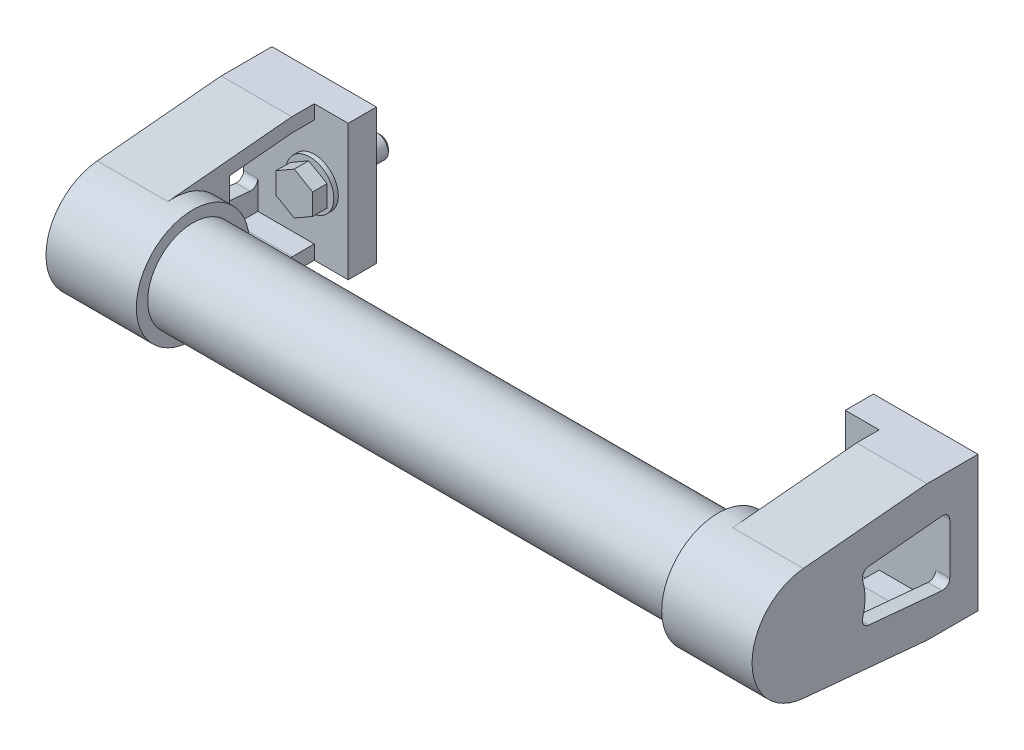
ISO-10303-21;
HEADER;
FILE_DESCRIPTION(('STEP AP214'),'2;1');
FILE_NAME('part.step','',(''),(''),'','','');
FILE_SCHEMA(('AUTOMOTIVE_DESIGN { 1 0 10303 214 1 1 1 1 }'));
ENDSEC;
DATA;
#1=APPLICATION_CONTEXT('core data for automotive mechanical design processes');
#2=APPLICATION_PROTOCOL_DEFINITION('international standard','automotive_design',2000,#1);
#3=PRODUCT_CONTEXT('',#1,'mechanical');
#4=PRODUCT('Part','Part','',(#3));
#5=PRODUCT_RELATED_PRODUCT_CATEGORY('part','',(#4));
#6=PRODUCT_DEFINITION_FORMATION('','',#4);
#7=PRODUCT_DEFINITION_CONTEXT('part definition',#1,'design');
#8=PRODUCT_DEFINITION('design','',#6,#7);
#9=PRODUCT_DEFINITION_SHAPE('','',#8);
#10=(LENGTH_UNIT() NAMED_UNIT(*) SI_UNIT(.MILLI.,.METRE.));
#11=(NAMED_UNIT(*) PLANE_ANGLE_UNIT() SI_UNIT($,.RADIAN.));
#12=(NAMED_UNIT(*) SI_UNIT($,.STERADIAN.) SOLID_ANGLE_UNIT());
#13=UNCERTAINTY_MEASURE_WITH_UNIT(LENGTH_MEASURE(1.E-05),#10,'distance_accuracy_value','');
#14=(GEOMETRIC_REPRESENTATION_CONTEXT(3) GLOBAL_UNCERTAINTY_ASSIGNED_CONTEXT((#13)) GLOBAL_UNIT_ASSIGNED_CONTEXT((#10,
#11,#12)) REPRESENTATION_CONTEXT('',''));
#15=CARTESIAN_POINT('',(0.,0.,0.));
#16=DIRECTION('',(0.,0.,1.));
#17=DIRECTION('',(1.,0.,0.));
#18=AXIS2_PLACEMENT_3D('',#15,#16,#17);
#19=CARTESIAN_POINT('',(193.,2.62246821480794E-12,60.));
#20=DIRECTION('',(-1.,0.,0.));
#21=DIRECTION('',(0.,0.,1.));
#22=AXIS2_PLACEMENT_3D('',#19,#20,#21);
#23=CYLINDRICAL_SURFACE('',#22,16.);
#24=CARTESIAN_POINT('',(193.,2.62246821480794E-12,60.));
#25=DIRECTION('',(1.,0.,0.));
#26=DIRECTION('',(0.,0.,-1.));
#27=AXIS2_PLACEMENT_3D('',#24,#25,#26);
#28=CIRCLE('',#27,16.);
#29=CARTESIAN_POINT('',(193.,2.62246821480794E-12,44.));
#30=VERTEX_POINT('',#29);
#31=EDGE_CURVE('E9',#30,#30,#28,.T.);
#32=ORIENTED_EDGE('',*,*,#31,.F.);
#33=EDGE_LOOP('',(#32));
#34=FACE_BOUND('',#33,.T.);
#35=CARTESIAN_POINT('',(7.,2.62246821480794E-12,60.));
#36=DIRECTION('',(1.,0.,0.));
#37=DIRECTION('',(0.,0.,-1.));
#38=AXIS2_PLACEMENT_3D('',#35,#36,#37);
#39=CIRCLE('',#38,16.);
#40=CARTESIAN_POINT('',(7.,2.62246821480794E-12,44.));
#41=VERTEX_POINT('',#40);
#42=EDGE_CURVE('E24',#41,#41,#39,.T.);
#43=ORIENTED_EDGE('',*,*,#42,.T.);
#44=EDGE_LOOP('',(#43));
#45=FACE_BOUND('',#44,.T.);
#46=ADVANCED_FACE('F14',(#34,#45),#23,.T.);
#47=CARTESIAN_POINT('',(0.,7.21644966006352E-13,17.1));
#48=DIRECTION('',(0.,0.,1.));
#49=DIRECTION('',(0.,-1.,0.));
#50=AXIS2_PLACEMENT_3D('',#47,#48,#49);
#51=PLANE('',#50);
#52=DIRECTION('',(-0.866025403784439,0.5,0.));
#53=VECTOR('',#52,1.);
#54=CARTESIAN_POINT('',(6.5,3.75277674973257,17.1));
#55=LINE('',#54,#53);
#56=CARTESIAN_POINT('',(6.5,3.75277674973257,17.1));
#57=VERTEX_POINT('',#56);
#58=CARTESIAN_POINT('',(0.,7.50555349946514,17.1));
#59=VERTEX_POINT('',#58);
#60=EDGE_CURVE('E534',#57,#59,#55,.T.);
#61=ORIENTED_EDGE('',*,*,#60,.T.);
#62=DIRECTION('',(-0.866025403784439,-0.5,0.));
#63=VECTOR('',#62,1.);
#64=CARTESIAN_POINT('',(0.,7.50555349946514,17.1));
#65=LINE('',#64,#63);
#66=CARTESIAN_POINT('',(-6.5,3.75277674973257,17.1));
#67=VERTEX_POINT('',#66);
#68=EDGE_CURVE('E538',#59,#67,#65,.T.);
#69=ORIENTED_EDGE('',*,*,#68,.T.);
#70=DIRECTION('',(0.,-1.,0.));
#71=VECTOR('',#70,1.);
#72=CARTESIAN_POINT('',(-6.5,3.75277674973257,17.1));
#73=LINE('',#72,#71);
#74=CARTESIAN_POINT('',(-6.5,-3.75277674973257,17.1));
#75=VERTEX_POINT('',#74);
#76=EDGE_CURVE('E545',#67,#75,#73,.T.);
#77=ORIENTED_EDGE('',*,*,#76,.T.);
#78=DIRECTION('',(0.866025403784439,-0.5,0.));
#79=VECTOR('',#78,1.);
#80=CARTESIAN_POINT('',(-6.5,-3.75277674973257,17.1));
#81=LINE('',#80,#79);
#82=CARTESIAN_POINT('',(0.,-7.50555349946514,17.1));
#83=VERTEX_POINT('',#82);
#84=EDGE_CURVE('E553',#75,#83,#81,.T.);
#85=ORIENTED_EDGE('',*,*,#84,.T.);
#86=DIRECTION('',(0.866025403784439,0.5,0.));
#87=VECTOR('',#86,1.);
#88=CARTESIAN_POINT('',(0.,-7.50555349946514,17.1));
#89=LINE('',#88,#87);
#90=CARTESIAN_POINT('',(6.5,-3.75277674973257,17.1));
#91=VERTEX_POINT('',#90);
#92=EDGE_CURVE('E556',#83,#91,#89,.T.);
#93=ORIENTED_EDGE('',*,*,#92,.T.);
#94=DIRECTION('',(0.,1.,0.));
#95=VECTOR('',#94,1.);
#96=CARTESIAN_POINT('',(6.5,-3.75277674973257,17.1));
#97=LINE('',#96,#95);
#98=EDGE_CURVE('E559',#91,#57,#97,.T.);
#99=ORIENTED_EDGE('',*,*,#98,.T.);
#100=EDGE_LOOP('',(#61,#69,#77,#85,#93,#99));
#101=FACE_BOUND('',#100,.T.);
#102=ADVANCED_FACE('F1110',(#101),#51,.T.);
#103=CARTESIAN_POINT('',(6.5,-3.75277674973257,12.));
#104=DIRECTION('',(1.,0.,0.));
#105=DIRECTION('',(0.,0.,-1.));
#106=AXIS2_PLACEMENT_3D('',#103,#104,#105);
#107=PLANE('',#106);
#108=DIRECTION('',(0.,1.,0.));
#109=VECTOR('',#108,1.);
#110=CARTESIAN_POINT('',(6.5,-3.75277674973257,12.));
#111=LINE('',#110,#109);
#112=CARTESIAN_POINT('',(6.5,-3.75277674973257,12.));
#113=VERTEX_POINT('',#112);
#114=CARTESIAN_POINT('',(6.5,3.75277674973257,12.));
#115=VERTEX_POINT('',#114);
#116=EDGE_CURVE('E548',#113,#115,#111,.T.);
#117=ORIENTED_EDGE('',*,*,#116,.T.);
#118=DIRECTION('',(0.,0.,1.));
#119=VECTOR('',#118,1.);
#120=CARTESIAN_POINT('',(6.5,3.75277674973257,12.));
#121=LINE('',#120,#119);
#122=EDGE_CURVE('E562',#115,#57,#121,.T.);
#123=ORIENTED_EDGE('',*,*,#122,.T.);
#124=ORIENTED_EDGE('',*,*,#98,.F.);
#125=DIRECTION('',(0.,0.,1.));
#126=VECTOR('',#125,1.);
#127=CARTESIAN_POINT('',(6.5,-3.75277674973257,12.));
#128=LINE('',#127,#126);
#129=EDGE_CURVE('E566',#113,#91,#128,.T.);
#130=ORIENTED_EDGE('',*,*,#129,.F.);
#131=EDGE_LOOP('',(#117,#123,#124,#130));
#132=FACE_BOUND('',#131,.T.);
#133=ADVANCED_FACE('F1118',(#132),#107,.T.);
#134=CARTESIAN_POINT('',(6.5,3.75277674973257,12.));
#135=DIRECTION('',(0.5,0.866025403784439,0.));
#136=DIRECTION('',(-0.866025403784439,0.5,0.));
#137=AXIS2_PLACEMENT_3D('',#134,#135,#136);
#138=PLANE('',#137);
#139=ORIENTED_EDGE('',*,*,#60,.F.);
#140=ORIENTED_EDGE('',*,*,#122,.F.);
#141=DIRECTION('',(-0.866025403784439,0.5,0.));
#142=VECTOR('',#141,1.);
#143=CARTESIAN_POINT('',(6.5,3.75277674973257,12.));
#144=LINE('',#143,#142);
#145=CARTESIAN_POINT('',(0.,7.50555349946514,12.));
#146=VERTEX_POINT('',#145);
#147=EDGE_CURVE('E561',#115,#146,#144,.T.);
#148=ORIENTED_EDGE('',*,*,#147,.T.);
#149=DIRECTION('',(0.,0.,1.));
#150=VECTOR('',#149,1.);
#151=CARTESIAN_POINT('',(0.,7.50555349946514,12.));
#152=LINE('',#151,#150);
#153=EDGE_CURVE('E578',#146,#59,#152,.T.);
#154=ORIENTED_EDGE('',*,*,#153,.T.);
#155=EDGE_LOOP('',(#139,#140,#148,#154));
#156=FACE_BOUND('',#155,.T.);
#157=ADVANCED_FACE('F1175',(#156),#138,.T.);
#158=CARTESIAN_POINT('',(0.,7.50555349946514,12.));
#159=DIRECTION('',(-0.5,0.866025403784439,0.));
#160=DIRECTION('',(-0.866025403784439,-0.5,0.));
#161=AXIS2_PLACEMENT_3D('',#158,#159,#160);
#162=PLANE('',#161);
#163=ORIENTED_EDGE('',*,*,#68,.F.);
#164=ORIENTED_EDGE('',*,*,#153,.F.);
#165=DIRECTION('',(-0.866025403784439,-0.5,0.));
#166=VECTOR('',#165,1.);
#167=CARTESIAN_POINT('',(0.,7.50555349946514,12.));
#168=LINE('',#167,#166);
#169=CARTESIAN_POINT('',(-6.5,3.75277674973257,12.));
#170=VERTEX_POINT('',#169);
#171=EDGE_CURVE('E1217',#146,#170,#168,.T.);
#172=ORIENTED_EDGE('',*,*,#171,.T.);
#173=DIRECTION('',(0.,0.,1.));
#174=VECTOR('',#173,1.);
#175=CARTESIAN_POINT('',(-6.5,3.75277674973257,12.));
#176=LINE('',#175,#174);
#177=EDGE_CURVE('E575',#170,#67,#176,.T.);
#178=ORIENTED_EDGE('',*,*,#177,.T.);
#179=EDGE_LOOP('',(#163,#164,#172,#178));
#180=FACE_BOUND('',#179,.T.);
#181=ADVANCED_FACE('F1120',(#180),#162,.T.);
#182=CARTESIAN_POINT('',(-6.5,3.75277674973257,12.));
#183=DIRECTION('',(-1.,0.,0.));
#184=DIRECTION('',(0.,0.,1.));
#185=AXIS2_PLACEMENT_3D('',#182,#183,#184);
#186=PLANE('',#185);
#187=DIRECTION('',(0.,-1.,0.));
#188=VECTOR('',#187,1.);
#189=CARTESIAN_POINT('',(-6.5,3.75277674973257,12.));
#190=LINE('',#189,#188);
#191=CARTESIAN_POINT('',(-6.5,-3.75277674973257,12.));
#192=VERTEX_POINT('',#191);
#193=EDGE_CURVE('E1219',#170,#192,#190,.T.);
#194=ORIENTED_EDGE('',*,*,#193,.T.);
#195=DIRECTION('',(0.,0.,1.));
#196=VECTOR('',#195,1.);
#197=CARTESIAN_POINT('',(-6.5,-3.75277674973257,12.));
#198=LINE('',#197,#196);
#199=EDGE_CURVE('E572',#192,#75,#198,.T.);
#200=ORIENTED_EDGE('',*,*,#199,.T.);
#201=ORIENTED_EDGE('',*,*,#76,.F.);
#202=ORIENTED_EDGE('',*,*,#177,.F.);
#203=EDGE_LOOP('',(#194,#200,#201,#202));
#204=FACE_BOUND('',#203,.T.);
#205=ADVANCED_FACE('F1182',(#204),#186,.T.);
#206=CARTESIAN_POINT('',(-6.5,-3.75277674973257,12.));
#207=DIRECTION('',(-0.5,-0.866025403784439,0.));
#208=DIRECTION('',(0.866025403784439,-0.5,0.));
#209=AXIS2_PLACEMENT_3D('',#206,#207,#208);
#210=PLANE('',#209);
#211=DIRECTION('',(0.866025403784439,-0.5,0.));
#212=VECTOR('',#211,1.);
#213=CARTESIAN_POINT('',(-6.5,-3.75277674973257,12.));
#214=LINE('',#213,#212);
#215=CARTESIAN_POINT('',(0.,-7.50555349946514,12.));
#216=VERTEX_POINT('',#215);
#217=EDGE_CURVE('E1225',#192,#216,#214,.T.);
#218=ORIENTED_EDGE('',*,*,#217,.T.);
#219=DIRECTION('',(0.,0.,1.));
#220=VECTOR('',#219,1.);
#221=CARTESIAN_POINT('',(0.,-7.50555349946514,12.));
#222=LINE('',#221,#220);
#223=EDGE_CURVE('E569',#216,#83,#222,.T.);
#224=ORIENTED_EDGE('',*,*,#223,.T.);
#225=ORIENTED_EDGE('',*,*,#84,.F.);
#226=ORIENTED_EDGE('',*,*,#199,.F.);
#227=EDGE_LOOP('',(#218,#224,#225,#226));
#228=FACE_BOUND('',#227,.T.);
#229=ADVANCED_FACE('F1186',(#228),#210,.T.);
#230=CARTESIAN_POINT('',(0.,-7.50555349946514,12.));
#231=DIRECTION('',(0.5,-0.866025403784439,0.));
#232=DIRECTION('',(0.866025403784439,0.5,0.));
#233=AXIS2_PLACEMENT_3D('',#230,#231,#232);
#234=PLANE('',#233);
#235=DIRECTION('',(0.866025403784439,0.5,0.));
#236=VECTOR('',#235,1.);
#237=CARTESIAN_POINT('',(0.,-7.50555349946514,12.));
#238=LINE('',#237,#236);
#239=EDGE_CURVE('E1211',#216,#113,#238,.T.);
#240=ORIENTED_EDGE('',*,*,#239,.T.);
#241=ORIENTED_EDGE('',*,*,#129,.T.);
#242=ORIENTED_EDGE('',*,*,#92,.F.);
#243=ORIENTED_EDGE('',*,*,#223,.F.);
#244=EDGE_LOOP('',(#240,#241,#242,#243));
#245=FACE_BOUND('',#244,.T.);
#246=ADVANCED_FACE('F1190',(#245),#234,.T.);
#247=CARTESIAN_POINT('',(-6.5,4.9960036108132E-13,12.));
#248=DIRECTION('',(0.,0.,-1.));
#249=DIRECTION('',(0.,1.,0.));
#250=AXIS2_PLACEMENT_3D('',#247,#248,#249);
#251=PLANE('',#250);
#252=CARTESIAN_POINT('',(0.,4.99600361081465E-13,12.));
#253=DIRECTION('',(0.,0.,1.));
#254=DIRECTION('',(0.,-1.,0.));
#255=AXIS2_PLACEMENT_3D('',#252,#253,#254);
#256=CIRCLE('',#255,5.85000000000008);
#257=CARTESIAN_POINT('',(0.,-5.84999999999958,12.0000000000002));
#258=VERTEX_POINT('',#257);
#259=EDGE_CURVE('E565',#258,#258,#256,.F.);
#260=ORIENTED_EDGE('',*,*,#259,.F.);
#261=EDGE_LOOP('',(#260));
#262=FACE_BOUND('',#261,.T.);
#263=ORIENTED_EDGE('',*,*,#239,.F.);
#264=ORIENTED_EDGE('',*,*,#217,.F.);
#265=ORIENTED_EDGE('',*,*,#193,.F.);
#266=ORIENTED_EDGE('',*,*,#171,.F.);
#267=ORIENTED_EDGE('',*,*,#147,.F.);
#268=ORIENTED_EDGE('',*,*,#116,.F.);
#269=EDGE_LOOP('',(#263,#264,#265,#266,#267,#268));
#270=FACE_BOUND('',#269,.T.);
#271=ADVANCED_FACE('F1179',(#262,#270),#251,.T.);
#272=CARTESIAN_POINT('',(0.,-5.55111512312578E-13,-13.4));
#273=DIRECTION('',(0.,0.,1.));
#274=DIRECTION('',(0.,-1.,0.));
#275=AXIS2_PLACEMENT_3D('',#272,#273,#274);
#276=PLANE('',#275);
#277=CARTESIAN_POINT('',(0.,-5.6060437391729E-13,-13.4));
#278=DIRECTION('',(0.,0.,1.));
#279=DIRECTION('',(0.,-1.,0.));
#280=AXIS2_PLACEMENT_3D('',#277,#278,#279);
#281=CIRCLE('',#280,2.79999999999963);
#282=CARTESIAN_POINT('',(0.,-2.80000000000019,-13.3999999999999));
#283=VERTEX_POINT('',#282);
#284=EDGE_CURVE('E886',#283,#283,#281,.F.);
#285=ORIENTED_EDGE('',*,*,#284,.T.);
#286=EDGE_LOOP('',(#285));
#287=FACE_BOUND('',#286,.T.);
#288=ADVANCED_FACE('F1108',(#287),#276,.F.);
#289=CARTESIAN_POINT('',(0.,3.33066907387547E-12,80.));
#290=DIRECTION('',(0.,0.,1.));
#291=DIRECTION('',(0.,-1.,0.));
#292=AXIS2_PLACEMENT_3D('',#289,#290,#291);
#293=CYLINDRICAL_SURFACE('',#292,5.85000000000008);
#294=ORIENTED_EDGE('',*,*,#259,.T.);
#295=EDGE_LOOP('',(#294));
#296=FACE_BOUND('',#295,.T.);
#297=CARTESIAN_POINT('',(0.,4.82947015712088E-13,11.6));
#298=DIRECTION('',(0.,0.,1.));
#299=DIRECTION('',(0.,-1.,0.));
#300=AXIS2_PLACEMENT_3D('',#297,#298,#299);
#301=CIRCLE('',#300,5.85000000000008);
#302=CARTESIAN_POINT('',(0.,-5.8499999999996,11.6000000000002));
#303=VERTEX_POINT('',#302);
#304=EDGE_CURVE('E879',#303,#303,#301,.F.);
#305=ORIENTED_EDGE('',*,*,#304,.F.);
#306=EDGE_LOOP('',(#305));
#307=FACE_BOUND('',#306,.T.);
#308=ADVANCED_FACE('F1105',(#296,#307),#293,.T.);
#309=CARTESIAN_POINT('',(0.,-5.10644337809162E-13,-12.2));
#310=DIRECTION('',(0.,0.,1.));
#311=DIRECTION('',(0.,-1.,0.));
#312=AXIS2_PLACEMENT_3D('',#309,#310,#311);
#313=CONICAL_SURFACE('',#312,3.99999999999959,0.785398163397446);
#314=ORIENTED_EDGE('',*,*,#284,.F.);
#315=EDGE_LOOP('',(#314));
#316=FACE_BOUND('',#315,.T.);
#317=CARTESIAN_POINT('',(0.,-5.10644337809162E-13,-12.2));
#318=DIRECTION('',(0.,0.,1.));
#319=DIRECTION('',(0.,-1.,0.));
#320=AXIS2_PLACEMENT_3D('',#317,#318,#319);
#321=CIRCLE('',#320,3.99999999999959);
#322=CARTESIAN_POINT('',(0.,-4.0000000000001,-12.1999999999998));
#323=VERTEX_POINT('',#322);
#324=EDGE_CURVE('E850',#323,#323,#321,.T.);
#325=ORIENTED_EDGE('',*,*,#324,.F.);
#326=EDGE_LOOP('',(#325));
#327=FACE_BOUND('',#326,.T.);
#328=ADVANCED_FACE('F1090',(#316,#327),#313,.T.);
#329=CARTESIAN_POINT('',(-5.85,4.71844785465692E-13,11.6));
#330=DIRECTION('',(0.,0.,1.));
#331=DIRECTION('',(0.,-1.,0.));
#332=AXIS2_PLACEMENT_3D('',#329,#330,#331);
#333=PLANE('',#332);
#334=CARTESIAN_POINT('',(0.,4.82947015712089E-13,11.6));
#335=DIRECTION('',(0.,0.,1.));
#336=DIRECTION('',(0.,-1.,0.));
#337=AXIS2_PLACEMENT_3D('',#334,#335,#336);
#338=CIRCLE('',#337,8.50000000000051);
#339=CARTESIAN_POINT('',(0.,-8.50000000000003,11.6000000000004));
#340=VERTEX_POINT('',#339);
#341=EDGE_CURVE('E826',#340,#340,#338,.F.);
#342=ORIENTED_EDGE('',*,*,#341,.F.);
#343=EDGE_LOOP('',(#342));
#344=FACE_BOUND('',#343,.T.);
#345=ORIENTED_EDGE('',*,*,#304,.T.);
#346=EDGE_LOOP('',(#345));
#347=FACE_BOUND('',#346,.T.);
#348=ADVANCED_FACE('F1104',(#344,#347),#333,.T.);
#349=CARTESIAN_POINT('',(0.,5.27355936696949E-13,12.7319341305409));
#350=DIRECTION('',(0.,0.,1.));
#351=DIRECTION('',(0.,-1.,0.));
#352=AXIS2_PLACEMENT_3D('',#349,#350,#351);
#353=CYLINDRICAL_SURFACE('',#352,3.99999999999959);
#354=ORIENTED_EDGE('',*,*,#324,.T.);
#355=EDGE_LOOP('',(#354));
#356=FACE_BOUND('',#355,.T.);
#357=CARTESIAN_POINT('',(0.,0.,0.));
#358=DIRECTION('',(0.,0.,1.));
#359=DIRECTION('',(0.,-1.,0.));
#360=AXIS2_PLACEMENT_3D('',#357,#358,#359);
#361=CIRCLE('',#360,3.99999999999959);
#362=CARTESIAN_POINT('',(0.,-3.99999999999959,1.1102230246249E-13));
#363=VERTEX_POINT('',#362);
#364=EDGE_CURVE('E721',#363,#363,#361,.T.);
#365=ORIENTED_EDGE('',*,*,#364,.F.);
#366=EDGE_LOOP('',(#365));
#367=FACE_BOUND('',#366,.T.);
#368=ADVANCED_FACE('F1402',(#356,#367),#353,.T.);
#369=CARTESIAN_POINT('',(0.,3.33066907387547E-12,80.));
#370=DIRECTION('',(0.,0.,1.));
#371=DIRECTION('',(0.,-1.,0.));
#372=AXIS2_PLACEMENT_3D('',#369,#370,#371);
#373=CYLINDRICAL_SURFACE('',#372,8.50000000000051);
#374=ORIENTED_EDGE('',*,*,#341,.T.);
#375=EDGE_LOOP('',(#374));
#376=FACE_BOUND('',#375,.T.);
#377=CARTESIAN_POINT('',(0.,4.16333634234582E-13,10.));
#378=DIRECTION('',(0.,0.,1.));
#379=DIRECTION('',(0.,-1.,0.));
#380=AXIS2_PLACEMENT_3D('',#377,#378,#379);
#381=CIRCLE('',#380,8.50000000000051);
#382=CARTESIAN_POINT('',(0.,-8.50000000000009,10.0000000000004));
#383=VERTEX_POINT('',#382);
#384=EDGE_CURVE('E687',#383,#383,#381,.T.);
#385=ORIENTED_EDGE('',*,*,#384,.T.);
#386=EDGE_LOOP('',(#385));
#387=FACE_BOUND('',#386,.T.);
#388=ADVANCED_FACE('F1397',(#376,#387),#373,.T.);
#389=CARTESIAN_POINT('',(-20.,-18.9999999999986,40.0000000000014));
#390=DIRECTION('',(1.,0.,0.));
#391=DIRECTION('',(0.,0.,-1.));
#392=AXIS2_PLACEMENT_3D('',#389,#390,#391);
#393=PLANE('',#392);
#394=DIRECTION('',(0.,1.,0.));
#395=VECTOR('',#394,1.);
#396=CARTESIAN_POINT('',(-20.,-8.94532766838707,10.0000000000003));
#397=LINE('',#396,#395);
#398=CARTESIAN_POINT('',(-20.,8.94532766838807,9.99999999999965));
#399=VERTEX_POINT('',#398);
#400=CARTESIAN_POINT('',(-20.,19.0000000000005,9.99999999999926));
#401=VERTEX_POINT('',#400);
#402=EDGE_CURVE('E684',#399,#401,#397,.T.);
#403=ORIENTED_EDGE('',*,*,#402,.T.);
#404=DIRECTION('',(0.,0.,-1.));
#405=VECTOR('',#404,1.);
#406=CARTESIAN_POINT('',(-20.,19.0000000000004,9.99999999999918));
#407=LINE('',#406,#405);
#408=CARTESIAN_POINT('',(-20.,19.0000000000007,17.7675646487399));
#409=VERTEX_POINT('',#408);
#410=EDGE_CURVE('E759',#409,#401,#407,.T.);
#411=ORIENTED_EDGE('',*,*,#410,.F.);
#412=DIRECTION('',(0.,0.0927736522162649,-0.995687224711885));
#413=VECTOR('',#412,1.);
#414=CARTESIAN_POINT('',(-20.,19.0000000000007,17.7675646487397));
#415=LINE('',#414,#413);
#416=CARTESIAN_POINT('',(-20.,16.9284817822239,40.));
#417=VERTEX_POINT('',#416);
#418=EDGE_CURVE('E760',#417,#409,#415,.T.);
#419=ORIENTED_EDGE('',*,*,#418,.F.);
#420=DIRECTION('',(0.,1.,0.));
#421=VECTOR('',#420,1.);
#422=CARTESIAN_POINT('',(-20.,-23.9999999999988,40.0000000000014));
#423=LINE('',#422,#421);
#424=CARTESIAN_POINT('',(-20.,8.50076165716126,40.));
#425=VERTEX_POINT('',#424);
#426=EDGE_CURVE('E770',#425,#417,#423,.T.);
#427=ORIENTED_EDGE('',*,*,#426,.F.);
#428=CARTESIAN_POINT('',(-20.,6.52582549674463,38.4671506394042));
#429=DIRECTION('',(-1.,0.,0.));
#430=DIRECTION('',(0.,0.,1.));
#431=AXIS2_PLACEMENT_3D('',#428,#429,#430);
#432=CIRCLE('',#431,2.5);
#433=CARTESIAN_POINT('',(-20.,9.01504355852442,38.699084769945));
#434=VERTEX_POINT('',#433);
#435=EDGE_CURVE('E698',#425,#434,#432,.T.);
#436=ORIENTED_EDGE('',*,*,#435,.T.);
#437=DIRECTION('',(0.,-0.0927736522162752,0.995687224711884));
#438=VECTOR('',#437,1.);
#439=CARTESIAN_POINT('',(-20.,11.4345457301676,12.7319341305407));
#440=LINE('',#439,#438);
#441=CARTESIAN_POINT('',(-20.,11.4345457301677,12.7319341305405));
#442=VERTEX_POINT('',#441);
#443=EDGE_CURVE('E702',#434,#442,#440,.F.);
#444=ORIENTED_EDGE('',*,*,#443,.T.);
#445=CARTESIAN_POINT('',(-20.,8.94532766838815,12.4999999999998));
#446=DIRECTION('',(-1.,0.,0.));
#447=DIRECTION('',(0.,0.,1.));
#448=AXIS2_PLACEMENT_3D('',#445,#446,#447);
#449=CIRCLE('',#448,2.5);
#450=EDGE_CURVE('E720',#442,#399,#449,.T.);
#451=ORIENTED_EDGE('',*,*,#450,.T.);
#452=EDGE_LOOP('',(#403,#411,#419,#427,#436,#444,#451));
#453=FACE_BOUND('',#452,.T.);
#454=ADVANCED_FACE('F1349',(#453),#393,.T.);
#455=CARTESIAN_POINT('',(-20.,-18.9999999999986,40.0000000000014));
#456=DIRECTION('',(1.,0.,0.));
#457=DIRECTION('',(0.,0.,-1.));
#458=AXIS2_PLACEMENT_3D('',#455,#456,#457);
#459=PLANE('',#458);
#460=DIRECTION('',(0.,1.,0.));
#461=VECTOR('',#460,1.);
#462=CARTESIAN_POINT('',(-20.,-23.9999999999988,40.0000000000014));
#463=LINE('',#462,#461);
#464=CARTESIAN_POINT('',(-20.,-16.9284817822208,40.0000000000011));
#465=VERTEX_POINT('',#464);
#466=CARTESIAN_POINT('',(-20.,-8.50076165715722,40.0000000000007));
#467=VERTEX_POINT('',#466);
#468=EDGE_CURVE('E791',#465,#467,#463,.T.);
#469=ORIENTED_EDGE('',*,*,#468,.F.);
#470=DIRECTION('',(0.,-0.0927736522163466,-0.995687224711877));
#471=VECTOR('',#470,1.);
#472=CARTESIAN_POINT('',(-20.,-18.9999999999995,17.7675646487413));
#473=LINE('',#472,#471);
#474=CARTESIAN_POINT('',(-20.,-18.9999999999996,17.7675646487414));
#475=VERTEX_POINT('',#474);
#476=EDGE_CURVE('E801',#465,#475,#473,.T.);
#477=ORIENTED_EDGE('',*,*,#476,.T.);
#478=DIRECTION('',(0.,0.,-1.));
#479=VECTOR('',#478,1.);
#480=CARTESIAN_POINT('',(-20.,-19.,10.0000000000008));
#481=LINE('',#480,#479);
#482=CARTESIAN_POINT('',(-20.,-19.,10.0000000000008));
#483=VERTEX_POINT('',#482);
#484=EDGE_CURVE('E823',#475,#483,#481,.T.);
#485=ORIENTED_EDGE('',*,*,#484,.T.);
#486=DIRECTION('',(0.,1.,0.));
#487=VECTOR('',#486,1.);
#488=CARTESIAN_POINT('',(-20.,-8.94532766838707,10.0000000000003));
#489=LINE('',#488,#487);
#490=CARTESIAN_POINT('',(-20.,-8.94532766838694,10.0000000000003));
#491=VERTEX_POINT('',#490);
#492=EDGE_CURVE('E681',#483,#491,#489,.T.);
#493=ORIENTED_EDGE('',*,*,#492,.T.);
#494=CARTESIAN_POINT('',(-20.,-8.94532766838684,12.5000000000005));
#495=DIRECTION('',(-1.,0.,0.));
#496=DIRECTION('',(0.,0.,1.));
#497=AXIS2_PLACEMENT_3D('',#494,#495,#496);
#498=CIRCLE('',#497,2.5);
#499=CARTESIAN_POINT('',(-20.,-11.4345457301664,12.7319341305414));
#500=VERTEX_POINT('',#499);
#501=EDGE_CURVE('E688',#491,#500,#498,.T.);
#502=ORIENTED_EDGE('',*,*,#501,.T.);
#503=DIRECTION('',(0.,0.0927736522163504,0.995687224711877));
#504=VECTOR('',#503,1.);
#505=CARTESIAN_POINT('',(-20.,-11.4345457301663,12.7319341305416));
#506=LINE('',#505,#504);
#507=CARTESIAN_POINT('',(-20.,-9.01504355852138,38.6990847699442));
#508=VERTEX_POINT('',#507);
#509=EDGE_CURVE('E692',#508,#500,#506,.F.);
#510=ORIENTED_EDGE('',*,*,#509,.F.);
#511=CARTESIAN_POINT('',(-20.,-6.52582549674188,38.4671506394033));
#512=DIRECTION('',(-1.,0.,0.));
#513=DIRECTION('',(0.,0.,1.));
#514=AXIS2_PLACEMENT_3D('',#511,#512,#513);
#515=CIRCLE('',#514,2.5);
#516=EDGE_CURVE('E697',#508,#467,#515,.T.);
#517=ORIENTED_EDGE('',*,*,#516,.T.);
#518=EDGE_LOOP('',(#469,#477,#485,#493,#502,#510,#517));
#519=FACE_BOUND('',#518,.T.);
#520=ADVANCED_FACE('F1292',(#519),#459,.T.);
#521=CARTESIAN_POINT('',(12.,-24.,10.0000000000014));
#522=DIRECTION('',(1.,0.,0.));
#523=DIRECTION('',(0.,0.,-1.));
#524=AXIS2_PLACEMENT_3D('',#521,#522,#523);
#525=PLANE('',#524);
#526=DIRECTION('',(0.,1.,0.));
#527=VECTOR('',#526,1.);
#528=CARTESIAN_POINT('',(12.,-24.0000000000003,9.43689570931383E-13));
#529=LINE('',#528,#527);
#530=CARTESIAN_POINT('',(12.,24.,-1.0177044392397E-12));
#531=VERTEX_POINT('',#530);
#532=CARTESIAN_POINT('',(12.,-24.0000000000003,9.43689570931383E-13));
#533=VERTEX_POINT('',#532);
#534=EDGE_CURVE('E717',#531,#533,#529,.F.);
#535=ORIENTED_EDGE('',*,*,#534,.F.);
#536=DIRECTION('',(0.,0.,1.));
#537=VECTOR('',#536,1.);
#538=CARTESIAN_POINT('',(12.,24.,-1.0547118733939E-12));
#539=LINE('',#538,#537);
#540=CARTESIAN_POINT('',(12.,24.0000000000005,9.99999999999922));
#541=VERTEX_POINT('',#540);
#542=EDGE_CURVE('E705',#541,#531,#539,.F.);
#543=ORIENTED_EDGE('',*,*,#542,.F.);
#544=DIRECTION('',(0.,1.,0.));
#545=VECTOR('',#544,1.);
#546=CARTESIAN_POINT('',(12.,-8.94532766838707,10.0000000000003));
#547=LINE('',#546,#545);
#548=CARTESIAN_POINT('',(12.,-24.,10.0000000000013));
#549=VERTEX_POINT('',#548);
#550=EDGE_CURVE('E732',#541,#549,#547,.F.);
#551=ORIENTED_EDGE('',*,*,#550,.T.);
#552=DIRECTION('',(0.,0.,1.));
#553=VECTOR('',#552,1.);
#554=CARTESIAN_POINT('',(12.,-24.0000000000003,9.43689570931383E-13));
#555=LINE('',#554,#553);
#556=EDGE_CURVE('E714',#549,#533,#555,.F.);
#557=ORIENTED_EDGE('',*,*,#556,.T.);
#558=EDGE_LOOP('',(#535,#543,#551,#557));
#559=FACE_BOUND('',#558,.T.);
#560=ADVANCED_FACE('F1331',(#559),#525,.T.);
#561=CARTESIAN_POINT('',(-11.,19.0000000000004,9.99999999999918));
#562=DIRECTION('',(0.,-1.,0.));
#563=DIRECTION('',(0.,0.,-1.));
#564=AXIS2_PLACEMENT_3D('',#561,#562,#563);
#565=PLANE('',#564);
#566=DIRECTION('',(1.,0.,0.));
#567=VECTOR('',#566,1.);
#568=CARTESIAN_POINT('',(16.,19.0000000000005,9.99999999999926));
#569=LINE('',#568,#567);
#570=CARTESIAN_POINT('',(0.,19.0000000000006,9.99999999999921));
#571=VERTEX_POINT('',#570);
#572=EDGE_CURVE('E746',#401,#571,#569,.T.);
#573=ORIENTED_EDGE('',*,*,#572,.T.);
#574=DIRECTION('',(0.,0.,-1.));
#575=VECTOR('',#574,1.);
#576=CARTESIAN_POINT('',(0.,19.0000000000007,60.));
#577=LINE('',#576,#575);
#578=CARTESIAN_POINT('',(0.,19.0000000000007,17.7675646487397));
#579=VERTEX_POINT('',#578);
#580=EDGE_CURVE('E741',#579,#571,#577,.T.);
#581=ORIENTED_EDGE('',*,*,#580,.F.);
#582=DIRECTION('',(1.,0.,0.));
#583=VECTOR('',#582,1.);
#584=CARTESIAN_POINT('',(-11.,19.0000000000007,17.7675646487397));
#585=LINE('',#584,#583);
#586=EDGE_CURVE('E756',#579,#409,#585,.F.);
#587=ORIENTED_EDGE('',*,*,#586,.T.);
#588=ORIENTED_EDGE('',*,*,#410,.T.);
#589=EDGE_LOOP('',(#573,#581,#587,#588));
#590=FACE_BOUND('',#589,.T.);
#591=ADVANCED_FACE('F1345',(#590),#565,.T.);
#592=CARTESIAN_POINT('',(-11.,19.0000000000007,17.7675646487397));
#593=DIRECTION('',(0.,-0.995687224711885,-0.0927736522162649));
#594=DIRECTION('',(0.,0.0927736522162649,-0.995687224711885));
#595=AXIS2_PLACEMENT_3D('',#592,#593,#594);
#596=PLANE('',#595);
#597=ORIENTED_EDGE('',*,*,#586,.F.);
#598=DIRECTION('',(0.,0.0927736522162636,-0.995687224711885));
#599=VECTOR('',#598,1.);
#600=CARTESIAN_POINT('',(0.,16.9284817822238,40.));
#601=LINE('',#600,#599);
#602=CARTESIAN_POINT('',(0.,16.9284817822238,40.));
#603=VERTEX_POINT('',#602);
#604=EDGE_CURVE('E635',#603,#579,#601,.T.);
#605=ORIENTED_EDGE('',*,*,#604,.F.);
#606=DIRECTION('',(1.,0.,0.));
#607=VECTOR('',#606,1.);
#608=CARTESIAN_POINT('',(-11.,16.9284817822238,40.));
#609=LINE('',#608,#607);
#610=EDGE_CURVE('E767',#603,#417,#609,.F.);
#611=ORIENTED_EDGE('',*,*,#610,.T.);
#612=ORIENTED_EDGE('',*,*,#418,.T.);
#613=EDGE_LOOP('',(#597,#605,#611,#612));
#614=FACE_BOUND('',#613,.T.);
#615=ADVANCED_FACE('F1377',(#614),#596,.T.);
#616=CARTESIAN_POINT('',(3.99999999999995,-23.9999999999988,40.0000000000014));
#617=DIRECTION('',(0.,0.,-1.));
#618=DIRECTION('',(0.,1.,0.));
#619=AXIS2_PLACEMENT_3D('',#616,#617,#618);
#620=PLANE('',#619);
#621=DIRECTION('',(-1.,0.,0.));
#622=VECTOR('',#621,1.);
#623=CARTESIAN_POINT('',(16.,8.50076165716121,40.));
#624=LINE('',#623,#622);
#625=CARTESIAN_POINT('',(0.,8.50076165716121,40.));
#626=VERTEX_POINT('',#625);
#627=EDGE_CURVE('E701',#626,#425,#624,.T.);
#628=ORIENTED_EDGE('',*,*,#627,.T.);
#629=ORIENTED_EDGE('',*,*,#426,.T.);
#630=ORIENTED_EDGE('',*,*,#610,.F.);
#631=DIRECTION('',(0.,1.,0.));
#632=VECTOR('',#631,1.);
#633=CARTESIAN_POINT('',(0.,2.62290189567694E-12,40.));
#634=LINE('',#633,#632);
#635=EDGE_CURVE('E632',#626,#603,#634,.T.);
#636=ORIENTED_EDGE('',*,*,#635,.F.);
#637=EDGE_LOOP('',(#628,#629,#630,#636));
#638=FACE_BOUND('',#637,.T.);
#639=ADVANCED_FACE('F1375',(#638),#620,.T.);
#640=CARTESIAN_POINT('',(16.,-24.0000000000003,9.43689570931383E-13));
#641=DIRECTION('',(0.,0.,-1.));
#642=DIRECTION('',(0.,1.,0.));
#643=AXIS2_PLACEMENT_3D('',#640,#641,#642);
#644=PLANE('',#643);
#645=DIRECTION('',(1.,0.,0.));
#646=VECTOR('',#645,1.);
#647=CARTESIAN_POINT('',(16.,-24.0000000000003,9.43689570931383E-13));
#648=LINE('',#647,#646);
#649=CARTESIAN_POINT('',(-25.,-24.0000000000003,-3.88578058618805E-13));
#650=VERTEX_POINT('',#649);
#651=EDGE_CURVE('E656',#533,#650,#648,.F.);
#652=ORIENTED_EDGE('',*,*,#651,.T.);
#653=DIRECTION('',(0.,1.,0.));
#654=VECTOR('',#653,1.);
#655=CARTESIAN_POINT('',(-25.,2.62290189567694E-12,-1.0547118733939E-12));
#656=LINE('',#655,#654);
#657=CARTESIAN_POINT('',(-25.,24.0000000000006,-1.0547118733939E-12));
#658=VERTEX_POINT('',#657);
#659=EDGE_CURVE('E612',#658,#650,#656,.F.);
#660=ORIENTED_EDGE('',*,*,#659,.F.);
#661=DIRECTION('',(1.,0.,0.));
#662=VECTOR('',#661,1.);
#663=CARTESIAN_POINT('',(16.,24.,-1.0547118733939E-12));
#664=LINE('',#663,#662);
#665=EDGE_CURVE('E645',#531,#658,#664,.F.);
#666=ORIENTED_EDGE('',*,*,#665,.F.);
#667=ORIENTED_EDGE('',*,*,#534,.T.);
#668=EDGE_LOOP('',(#652,#660,#666,#667));
#669=FACE_BOUND('',#668,.T.);
#670=ORIENTED_EDGE('',*,*,#364,.T.);
#671=EDGE_LOOP('',(#670));
#672=FACE_BOUND('',#671,.T.);
#673=ADVANCED_FACE('F1334',(#669,#672),#644,.T.);
#674=CARTESIAN_POINT('',(16.,24.,-1.0547118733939E-12));
#675=DIRECTION('',(0.,1.,0.));
#676=DIRECTION('',(0.,0.,1.));
#677=AXIS2_PLACEMENT_3D('',#674,#675,#676);
#678=PLANE('',#677);
#679=DIRECTION('',(0.,0.,1.));
#680=VECTOR('',#679,1.);
#681=CARTESIAN_POINT('',(-25.,24.0000000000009,60.));
#682=LINE('',#681,#680);
#683=CARTESIAN_POINT('',(-25.,24.0000000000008,17.999999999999));
#684=VERTEX_POINT('',#683);
#685=EDGE_CURVE('E609',#684,#658,#682,.F.);
#686=ORIENTED_EDGE('',*,*,#685,.F.);
#687=DIRECTION('',(1.,0.,0.));
#688=VECTOR('',#687,1.);
#689=CARTESIAN_POINT('',(16.,24.0000000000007,17.999999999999));
#690=LINE('',#689,#688);
#691=CARTESIAN_POINT('',(0.,24.0000000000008,17.999999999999));
#692=VERTEX_POINT('',#691);
#693=EDGE_CURVE('E592',#692,#684,#690,.F.);
#694=ORIENTED_EDGE('',*,*,#693,.F.);
#695=DIRECTION('',(0.,0.,1.));
#696=VECTOR('',#695,1.);
#697=CARTESIAN_POINT('',(0.,24.,-1.0547118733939E-12));
#698=LINE('',#697,#696);
#699=CARTESIAN_POINT('',(0.,24.0000000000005,9.99999999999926));
#700=VERTEX_POINT('',#699);
#701=EDGE_CURVE('E621',#692,#700,#698,.F.);
#702=ORIENTED_EDGE('',*,*,#701,.T.);
#703=DIRECTION('',(1.,0.,0.));
#704=VECTOR('',#703,1.);
#705=CARTESIAN_POINT('',(16.,24.0000000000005,9.9999999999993));
#706=LINE('',#705,#704);
#707=EDGE_CURVE('E624',#700,#541,#706,.T.);
#708=ORIENTED_EDGE('',*,*,#707,.T.);
#709=ORIENTED_EDGE('',*,*,#542,.T.);
#710=ORIENTED_EDGE('',*,*,#665,.T.);
#711=EDGE_LOOP('',(#686,#694,#702,#708,#709,#710));
#712=FACE_BOUND('',#711,.T.);
#713=ADVANCED_FACE('F1156',(#712),#678,.T.);
#714=CARTESIAN_POINT('',(16.,6.52582549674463,38.4671506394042));
#715=DIRECTION('',(-1.,0.,0.));
#716=DIRECTION('',(0.,0.,1.));
#717=AXIS2_PLACEMENT_3D('',#714,#715,#716);
#718=CYLINDRICAL_SURFACE('',#717,2.5);
#719=CARTESIAN_POINT('',(0.,6.52582549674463,38.4671506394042));
#720=DIRECTION('',(-1.,0.,0.));
#721=DIRECTION('',(0.,0.,1.));
#722=AXIS2_PLACEMENT_3D('',#719,#720,#721);
#723=CIRCLE('',#722,2.5);
#724=CARTESIAN_POINT('',(0.,5.80073377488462,40.8596894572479));
#725=VERTEX_POINT('',#724);
#726=EDGE_CURVE('E625',#725,#626,#723,.T.);
#727=ORIENTED_EDGE('',*,*,#726,.F.);
#728=DIRECTION('',(-1.,0.,0.));
#729=VECTOR('',#728,1.);
#730=CARTESIAN_POINT('',(7.,5.8007337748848,40.8596894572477));
#731=LINE('',#730,#729);
#732=CARTESIAN_POINT('',(-25.,5.80073377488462,40.8596894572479));
#733=VERTEX_POINT('',#732);
#734=EDGE_CURVE('E598',#733,#725,#731,.F.);
#735=ORIENTED_EDGE('',*,*,#734,.F.);
#736=CARTESIAN_POINT('',(-25.,6.52582549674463,38.4671506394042));
#737=DIRECTION('',(-1.,0.,0.));
#738=DIRECTION('',(0.,0.,1.));
#739=AXIS2_PLACEMENT_3D('',#736,#737,#738);
#740=CIRCLE('',#739,2.5);
#741=CARTESIAN_POINT('',(-25.,9.01504355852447,38.699084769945));
#742=VERTEX_POINT('',#741);
#743=EDGE_CURVE('E607',#742,#733,#740,.F.);
#744=ORIENTED_EDGE('',*,*,#743,.F.);
#745=DIRECTION('',(-1.,0.,0.));
#746=VECTOR('',#745,1.);
#747=CARTESIAN_POINT('',(16.,9.01504355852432,38.6990847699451));
#748=LINE('',#747,#746);
#749=EDGE_CURVE('E694',#434,#742,#748,.T.);
#750=ORIENTED_EDGE('',*,*,#749,.F.);
#751=ORIENTED_EDGE('',*,*,#435,.F.);
#752=ORIENTED_EDGE('',*,*,#627,.F.);
#753=EDGE_LOOP('',(#727,#735,#744,#750,#751,#752));
#754=FACE_BOUND('',#753,.T.);
#755=ADVANCED_FACE('F1369',(#754),#718,.F.);
#756=CARTESIAN_POINT('',(7.,11.4345457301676,12.7319341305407));
#757=DIRECTION('',(0.,0.995687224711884,0.0927736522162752));
#758=DIRECTION('',(0.,-0.0927736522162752,0.995687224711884));
#759=AXIS2_PLACEMENT_3D('',#756,#757,#758);
#760=PLANE('',#759);
#761=DIRECTION('',(0.,-0.0927736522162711,0.995687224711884));
#762=VECTOR('',#761,1.);
#763=CARTESIAN_POINT('',(-25.,11.4345457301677,12.7319341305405));
#764=LINE('',#763,#762);
#765=CARTESIAN_POINT('',(-25.,11.4345457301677,12.7319341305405));
#766=VERTEX_POINT('',#765);
#767=EDGE_CURVE('E604',#766,#742,#764,.T.);
#768=ORIENTED_EDGE('',*,*,#767,.F.);
#769=DIRECTION('',(1.,0.,0.));
#770=VECTOR('',#769,1.);
#771=CARTESIAN_POINT('',(7.,11.4345457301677,12.7319341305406));
#772=LINE('',#771,#770);
#773=EDGE_CURVE('E699',#442,#766,#772,.F.);
#774=ORIENTED_EDGE('',*,*,#773,.F.);
#775=ORIENTED_EDGE('',*,*,#443,.F.);
#776=ORIENTED_EDGE('',*,*,#749,.T.);
#777=EDGE_LOOP('',(#768,#774,#775,#776));
#778=FACE_BOUND('',#777,.T.);
#779=ADVANCED_FACE('F1989',(#778),#760,.F.);
#780=CARTESIAN_POINT('',(7.,8.94532766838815,12.4999999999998));
#781=DIRECTION('',(-1.,0.,0.));
#782=DIRECTION('',(0.,0.,1.));
#783=AXIS2_PLACEMENT_3D('',#780,#781,#782);
#784=CYLINDRICAL_SURFACE('',#783,2.5);
#785=ORIENTED_EDGE('',*,*,#773,.T.);
#786=CARTESIAN_POINT('',(-25.,8.94532766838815,12.4999999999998));
#787=DIRECTION('',(-1.,0.,0.));
#788=DIRECTION('',(0.,0.,1.));
#789=AXIS2_PLACEMENT_3D('',#786,#787,#788);
#790=CIRCLE('',#789,2.5);
#791=CARTESIAN_POINT('',(-25.,8.94532766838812,10.));
#792=VERTEX_POINT('',#791);
#793=EDGE_CURVE('E608',#792,#766,#790,.F.);
#794=ORIENTED_EDGE('',*,*,#793,.F.);
#795=DIRECTION('',(1.,0.,0.));
#796=VECTOR('',#795,1.);
#797=CARTESIAN_POINT('',(16.,8.94532766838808,9.99999999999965));
#798=LINE('',#797,#796);
#799=EDGE_CURVE('E680',#792,#399,#798,.T.);
#800=ORIENTED_EDGE('',*,*,#799,.T.);
#801=ORIENTED_EDGE('',*,*,#450,.F.);
#802=EDGE_LOOP('',(#785,#794,#800,#801));
#803=FACE_BOUND('',#802,.T.);
#804=ADVANCED_FACE('F1980',(#803),#784,.F.);
#805=CARTESIAN_POINT('',(7.,-8.94532766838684,12.5000000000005));
#806=DIRECTION('',(-1.,0.,0.));
#807=DIRECTION('',(0.,0.,1.));
#808=AXIS2_PLACEMENT_3D('',#805,#806,#807);
#809=CYLINDRICAL_SURFACE('',#808,2.5);
#810=CARTESIAN_POINT('',(-25.,-8.94532766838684,12.5000000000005));
#811=DIRECTION('',(-1.,0.,0.));
#812=DIRECTION('',(0.,0.,1.));
#813=AXIS2_PLACEMENT_3D('',#810,#811,#812);
#814=CIRCLE('',#813,2.5);
#815=CARTESIAN_POINT('',(-25.,-11.4345457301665,12.7319341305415));
#816=VERTEX_POINT('',#815);
#817=CARTESIAN_POINT('',(-25.,-8.94532766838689,10.0000000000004));
#818=VERTEX_POINT('',#817);
#819=EDGE_CURVE('E599',#816,#818,#814,.F.);
#820=ORIENTED_EDGE('',*,*,#819,.F.);
#821=DIRECTION('',(-1.,0.,0.));
#822=VECTOR('',#821,1.);
#823=CARTESIAN_POINT('',(7.,-11.4345457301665,12.7319341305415));
#824=LINE('',#823,#822);
#825=EDGE_CURVE('E685',#500,#816,#824,.T.);
#826=ORIENTED_EDGE('',*,*,#825,.F.);
#827=ORIENTED_EDGE('',*,*,#501,.F.);
#828=DIRECTION('',(1.,0.,0.));
#829=VECTOR('',#828,1.);
#830=CARTESIAN_POINT('',(16.,-8.94532766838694,10.0000000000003));
#831=LINE('',#830,#829);
#832=EDGE_CURVE('E678',#491,#818,#831,.F.);
#833=ORIENTED_EDGE('',*,*,#832,.T.);
#834=EDGE_LOOP('',(#820,#826,#827,#833));
#835=FACE_BOUND('',#834,.T.);
#836=ADVANCED_FACE('F1307',(#835),#809,.F.);
#837=CARTESIAN_POINT('',(7.,-11.4345457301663,12.7319341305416));
#838=DIRECTION('',(0.,0.995687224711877,-0.0927736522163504));
#839=DIRECTION('',(0.,0.0927736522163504,0.995687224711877));
#840=AXIS2_PLACEMENT_3D('',#837,#838,#839);
#841=PLANE('',#840);
#842=ORIENTED_EDGE('',*,*,#825,.T.);
#843=DIRECTION('',(0.,-0.0927736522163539,-0.995687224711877));
#844=VECTOR('',#843,1.);
#845=CARTESIAN_POINT('',(-25.,-9.01504355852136,38.6990847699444));
#846=LINE('',#845,#844);
#847=CARTESIAN_POINT('',(-25.,-9.01504355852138,38.6990847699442));
#848=VERTEX_POINT('',#847);
#849=EDGE_CURVE('E600',#848,#816,#846,.T.);
#850=ORIENTED_EDGE('',*,*,#849,.F.);
#851=DIRECTION('',(1.,0.,0.));
#852=VECTOR('',#851,1.);
#853=CARTESIAN_POINT('',(7.,-9.01504355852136,38.6990847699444));
#854=LINE('',#853,#852);
#855=EDGE_CURVE('E689',#848,#508,#854,.T.);
#856=ORIENTED_EDGE('',*,*,#855,.T.);
#857=ORIENTED_EDGE('',*,*,#509,.T.);
#858=EDGE_LOOP('',(#842,#850,#856,#857));
#859=FACE_BOUND('',#858,.T.);
#860=ADVANCED_FACE('F1311',(#859),#841,.T.);
#861=CARTESIAN_POINT('',(-11.,-18.9999999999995,17.7675646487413));
#862=DIRECTION('',(0.,-0.995687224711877,0.0927736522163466));
#863=DIRECTION('',(0.,-0.0927736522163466,-0.995687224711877));
#864=AXIS2_PLACEMENT_3D('',#861,#862,#863);
#865=PLANE('',#864);
#866=ORIENTED_EDGE('',*,*,#476,.F.);
#867=DIRECTION('',(1.,0.,0.));
#868=VECTOR('',#867,1.);
#869=CARTESIAN_POINT('',(3.99999999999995,-16.9284817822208,40.0000000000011));
#870=LINE('',#869,#868);
#871=CARTESIAN_POINT('',(0.,-16.9284817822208,40.0000000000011));
#872=VERTEX_POINT('',#871);
#873=EDGE_CURVE('E788',#872,#465,#870,.F.);
#874=ORIENTED_EDGE('',*,*,#873,.F.);
#875=DIRECTION('',(0.,0.0927736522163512,0.995687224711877));
#876=VECTOR('',#875,1.);
#877=CARTESIAN_POINT('',(0.,-18.9999999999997,17.7675646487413));
#878=LINE('',#877,#876);
#879=CARTESIAN_POINT('',(0.,-19.,17.7675646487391));
#880=VERTEX_POINT('',#879);
#881=EDGE_CURVE('E668',#880,#872,#878,.T.);
#882=ORIENTED_EDGE('',*,*,#881,.F.);
#883=DIRECTION('',(1.,0.,0.));
#884=VECTOR('',#883,1.);
#885=CARTESIAN_POINT('',(-11.,-18.9999999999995,17.7675646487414));
#886=LINE('',#885,#884);
#887=EDGE_CURVE('E792',#475,#880,#886,.T.);
#888=ORIENTED_EDGE('',*,*,#887,.F.);
#889=EDGE_LOOP('',(#866,#874,#882,#888));
#890=FACE_BOUND('',#889,.T.);
#891=ADVANCED_FACE('F1322',(#890),#865,.F.);
#892=CARTESIAN_POINT('',(-11.,-19.,10.0000000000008));
#893=DIRECTION('',(0.,-1.,0.));
#894=DIRECTION('',(0.,0.,-1.));
#895=AXIS2_PLACEMENT_3D('',#892,#893,#894);
#896=PLANE('',#895);
#897=ORIENTED_EDGE('',*,*,#484,.F.);
#898=ORIENTED_EDGE('',*,*,#887,.T.);
#899=DIRECTION('',(0.,0.,-1.));
#900=VECTOR('',#899,1.);
#901=CARTESIAN_POINT('',(0.,-19.,38.4671506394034));
#902=LINE('',#901,#900);
#903=CARTESIAN_POINT('',(0.,-19.,10.0000000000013));
#904=VERTEX_POINT('',#903);
#905=EDGE_CURVE('E775',#904,#880,#902,.F.);
#906=ORIENTED_EDGE('',*,*,#905,.F.);
#907=DIRECTION('',(1.,0.,0.));
#908=VECTOR('',#907,1.);
#909=CARTESIAN_POINT('',(16.,-19.,10.0000000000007));
#910=LINE('',#909,#908);
#911=EDGE_CURVE('E735',#904,#483,#910,.F.);
#912=ORIENTED_EDGE('',*,*,#911,.T.);
#913=EDGE_LOOP('',(#897,#898,#906,#912));
#914=FACE_BOUND('',#913,.T.);
#915=ADVANCED_FACE('F1298',(#914),#896,.F.);
#916=CARTESIAN_POINT('',(16.,-8.94532766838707,10.0000000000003));
#917=DIRECTION('',(0.,0.,-1.));
#918=DIRECTION('',(0.,1.,0.));
#919=AXIS2_PLACEMENT_3D('',#916,#917,#918);
#920=PLANE('',#919);
#921=ORIENTED_EDGE('',*,*,#572,.F.);
#922=ORIENTED_EDGE('',*,*,#402,.F.);
#923=ORIENTED_EDGE('',*,*,#799,.F.);
#924=DIRECTION('',(0.,1.,0.));
#925=VECTOR('',#924,1.);
#926=CARTESIAN_POINT('',(-25.,2.62290189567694E-12,10.0000000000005));
#927=LINE('',#926,#925);
#928=EDGE_CURVE('E595',#818,#792,#927,.T.);
#929=ORIENTED_EDGE('',*,*,#928,.F.);
#930=ORIENTED_EDGE('',*,*,#832,.F.);
#931=ORIENTED_EDGE('',*,*,#492,.F.);
#932=ORIENTED_EDGE('',*,*,#911,.F.);
#933=DIRECTION('',(0.,1.,0.));
#934=VECTOR('',#933,1.);
#935=CARTESIAN_POINT('',(0.,-6.52582549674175,10.0000000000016));
#936=LINE('',#935,#934);
#937=CARTESIAN_POINT('',(0.,-24.,10.0000000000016));
#938=VERTEX_POINT('',#937);
#939=EDGE_CURVE('E749',#938,#904,#936,.T.);
#940=ORIENTED_EDGE('',*,*,#939,.F.);
#941=DIRECTION('',(1.,0.,0.));
#942=VECTOR('',#941,1.);
#943=CARTESIAN_POINT('',(16.,-24.,10.0000000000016));
#944=LINE('',#943,#942);
#945=EDGE_CURVE('E636',#938,#549,#944,.T.);
#946=ORIENTED_EDGE('',*,*,#945,.T.);
#947=ORIENTED_EDGE('',*,*,#550,.F.);
#948=ORIENTED_EDGE('',*,*,#707,.F.);
#949=DIRECTION('',(0.,1.,0.));
#950=VECTOR('',#949,1.);
#951=CARTESIAN_POINT('',(0.,2.62290189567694E-12,9.99999999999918));
#952=LINE('',#951,#950);
#953=EDGE_CURVE('E738',#571,#700,#952,.T.);
#954=ORIENTED_EDGE('',*,*,#953,.F.);
#955=EDGE_LOOP('',(#921,#922,#923,#929,#930,#931,#932,#940,#946,#947,#948,#954));
#956=FACE_BOUND('',#955,.T.);
#957=ORIENTED_EDGE('',*,*,#384,.F.);
#958=EDGE_LOOP('',(#957));
#959=FACE_BOUND('',#958,.T.);
#960=ADVANCED_FACE('F1141',(#956,#959),#920,.F.);
#961=CARTESIAN_POINT('',(16.,-6.52582549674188,38.4671506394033));
#962=DIRECTION('',(-1.,0.,0.));
#963=DIRECTION('',(0.,0.,1.));
#964=AXIS2_PLACEMENT_3D('',#961,#962,#963);
#965=CYLINDRICAL_SURFACE('',#964,2.5);
#966=CARTESIAN_POINT('',(0.,-6.52582549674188,38.4671506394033));
#967=DIRECTION('',(-1.,0.,0.));
#968=DIRECTION('',(0.,0.,1.));
#969=AXIS2_PLACEMENT_3D('',#966,#967,#968);
#970=CIRCLE('',#969,2.5);
#971=CARTESIAN_POINT('',(0.,-8.50076165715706,40.0000000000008));
#972=VERTEX_POINT('',#971);
#973=CARTESIAN_POINT('',(0.,-5.80073377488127,40.8596894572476));
#974=VERTEX_POINT('',#973);
#975=EDGE_CURVE('E667',#972,#974,#970,.T.);
#976=ORIENTED_EDGE('',*,*,#975,.F.);
#977=DIRECTION('',(-1.,0.,0.));
#978=VECTOR('',#977,1.);
#979=CARTESIAN_POINT('',(16.,-8.50076165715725,40.0000000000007));
#980=LINE('',#979,#978);
#981=EDGE_CURVE('E693',#467,#972,#980,.F.);
#982=ORIENTED_EDGE('',*,*,#981,.F.);
#983=ORIENTED_EDGE('',*,*,#516,.F.);
#984=ORIENTED_EDGE('',*,*,#855,.F.);
#985=CARTESIAN_POINT('',(-25.,-6.52582549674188,38.4671506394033));
#986=DIRECTION('',(-1.,0.,0.));
#987=DIRECTION('',(0.,0.,1.));
#988=AXIS2_PLACEMENT_3D('',#985,#986,#987);
#989=CIRCLE('',#988,2.5);
#990=CARTESIAN_POINT('',(-25.,-5.80073377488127,40.8596894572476));
#991=VERTEX_POINT('',#990);
#992=EDGE_CURVE('E603',#991,#848,#989,.F.);
#993=ORIENTED_EDGE('',*,*,#992,.F.);
#994=DIRECTION('',(-1.,0.,0.));
#995=VECTOR('',#994,1.);
#996=CARTESIAN_POINT('',(7.,-5.80073377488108,40.8596894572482));
#997=LINE('',#996,#995);
#998=EDGE_CURVE('E671',#974,#991,#997,.T.);
#999=ORIENTED_EDGE('',*,*,#998,.F.);
#1000=EDGE_LOOP('',(#976,#982,#983,#984,#993,#999));
#1001=FACE_BOUND('',#1000,.T.);
#1002=ADVANCED_FACE('F1314',(#1001),#965,.F.);
#1003=CARTESIAN_POINT('',(3.99999999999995,-23.9999999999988,40.0000000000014));
#1004=DIRECTION('',(0.,0.,-1.));
#1005=DIRECTION('',(0.,1.,0.));
#1006=AXIS2_PLACEMENT_3D('',#1003,#1004,#1005);
#1007=PLANE('',#1006);
#1008=ORIENTED_EDGE('',*,*,#873,.T.);
#1009=ORIENTED_EDGE('',*,*,#468,.T.);
#1010=ORIENTED_EDGE('',*,*,#981,.T.);
#1011=DIRECTION('',(0.,1.,0.));
#1012=VECTOR('',#1011,1.);
#1013=CARTESIAN_POINT('',(0.,-6.52582549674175,40.0000000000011));
#1014=LINE('',#1013,#1012);
#1015=EDGE_CURVE('E664',#872,#972,#1014,.T.);
#1016=ORIENTED_EDGE('',*,*,#1015,.F.);
#1017=EDGE_LOOP('',(#1008,#1009,#1010,#1016));
#1018=FACE_BOUND('',#1017,.T.);
#1019=ADVANCED_FACE('F1157',(#1018),#1007,.T.);
#1020=CARTESIAN_POINT('',(16.,-24.0000000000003,9.43689570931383E-13));
#1021=DIRECTION('',(0.,1.,0.));
#1022=DIRECTION('',(0.,0.,1.));
#1023=AXIS2_PLACEMENT_3D('',#1020,#1021,#1022);
#1024=PLANE('',#1023);
#1025=DIRECTION('',(0.,0.,1.));
#1026=VECTOR('',#1025,1.);
#1027=CARTESIAN_POINT('',(0.,-24.0000000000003,9.43689570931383E-13));
#1028=LINE('',#1027,#1026);
#1029=CARTESIAN_POINT('',(0.,-23.9999999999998,17.999999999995));
#1030=VERTEX_POINT('',#1029);
#1031=EDGE_CURVE('E653',#1030,#938,#1028,.F.);
#1032=ORIENTED_EDGE('',*,*,#1031,.F.);
#1033=DIRECTION('',(1.,0.,0.));
#1034=VECTOR('',#1033,1.);
#1035=CARTESIAN_POINT('',(16.,-24.,17.999999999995));
#1036=LINE('',#1035,#1034);
#1037=CARTESIAN_POINT('',(-25.,-24.,17.999999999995));
#1038=VERTEX_POINT('',#1037);
#1039=EDGE_CURVE('E640',#1030,#1038,#1036,.F.);
#1040=ORIENTED_EDGE('',*,*,#1039,.T.);
#1041=DIRECTION('',(0.,0.,1.));
#1042=VECTOR('',#1041,1.);
#1043=CARTESIAN_POINT('',(-25.,-24.0000000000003,60.));
#1044=LINE('',#1043,#1042);
#1045=EDGE_CURVE('E613',#650,#1038,#1044,.T.);
#1046=ORIENTED_EDGE('',*,*,#1045,.F.);
#1047=ORIENTED_EDGE('',*,*,#651,.F.);
#1048=ORIENTED_EDGE('',*,*,#556,.F.);
#1049=ORIENTED_EDGE('',*,*,#945,.F.);
#1050=EDGE_LOOP('',(#1032,#1040,#1046,#1047,#1048,#1049));
#1051=FACE_BOUND('',#1050,.T.);
#1052=ADVANCED_FACE('F1142',(#1051),#1024,.F.);
#1053=CARTESIAN_POINT('',(16.,24.0000000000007,17.999999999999));
#1054=DIRECTION('',(0.,0.995687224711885,0.092773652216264));
#1055=DIRECTION('',(0.,-0.092773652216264,0.995687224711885));
#1056=AXIS2_PLACEMENT_3D('',#1053,#1054,#1055);
#1057=PLANE('',#1056);
#1058=DIRECTION('',(1.,0.,0.));
#1059=VECTOR('',#1058,1.);
#1060=CARTESIAN_POINT('',(16.,19.9137444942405,61.8554730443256));
#1061=LINE('',#1060,#1059);
#1062=CARTESIAN_POINT('',(-25.,19.9137444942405,61.8554730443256));
#1063=VERTEX_POINT('',#1062);
#1064=CARTESIAN_POINT('',(0.,19.9137444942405,61.8554730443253));
#1065=VERTEX_POINT('',#1064);
#1066=EDGE_CURVE('E581',#1063,#1065,#1061,.T.);
#1067=ORIENTED_EDGE('',*,*,#1066,.T.);
#1068=DIRECTION('',(0.,-0.092773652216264,0.995687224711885));
#1069=VECTOR('',#1068,1.);
#1070=CARTESIAN_POINT('',(0.,24.0000000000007,17.999999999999));
#1071=LINE('',#1070,#1069);
#1072=EDGE_CURVE('E618',#1065,#692,#1071,.F.);
#1073=ORIENTED_EDGE('',*,*,#1072,.T.);
#1074=ORIENTED_EDGE('',*,*,#693,.T.);
#1075=DIRECTION('',(0.,-0.092773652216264,0.995687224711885));
#1076=VECTOR('',#1075,1.);
#1077=CARTESIAN_POINT('',(-25.,24.0000000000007,17.999999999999));
#1078=LINE('',#1077,#1076);
#1079=EDGE_CURVE('E585',#684,#1063,#1078,.T.);
#1080=ORIENTED_EDGE('',*,*,#1079,.T.);
#1081=EDGE_LOOP('',(#1067,#1073,#1074,#1080));
#1082=FACE_BOUND('',#1081,.T.);
#1083=ADVANCED_FACE('F1129',(#1082),#1057,.T.);
#1084=CARTESIAN_POINT('',(0.,2.62290189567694E-12,60.));
#1085=DIRECTION('',(1.,0.,0.));
#1086=DIRECTION('',(0.,0.,-1.));
#1087=AXIS2_PLACEMENT_3D('',#1084,#1085,#1086);
#1088=PLANE('',#1087);
#1089=ORIENTED_EDGE('',*,*,#701,.F.);
#1090=ORIENTED_EDGE('',*,*,#1072,.F.);
#1091=CARTESIAN_POINT('',(0.,2.62290189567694E-12,60.));
#1092=DIRECTION('',(-1.,0.,0.));
#1093=DIRECTION('',(0.,0.,1.));
#1094=AXIS2_PLACEMENT_3D('',#1091,#1092,#1093);
#1095=CIRCLE('',#1094,20.0000000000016);
#1096=EDGE_CURVE('E677',#725,#1065,#1095,.F.);
#1097=ORIENTED_EDGE('',*,*,#1096,.F.);
#1098=ORIENTED_EDGE('',*,*,#726,.T.);
#1099=ORIENTED_EDGE('',*,*,#635,.T.);
#1100=ORIENTED_EDGE('',*,*,#604,.T.);
#1101=ORIENTED_EDGE('',*,*,#580,.T.);
#1102=ORIENTED_EDGE('',*,*,#953,.T.);
#1103=EDGE_LOOP('',(#1089,#1090,#1097,#1098,#1099,#1100,#1101,#1102));
#1104=FACE_BOUND('',#1103,.T.);
#1105=ADVANCED_FACE('F1146',(#1104),#1088,.T.);
#1106=CARTESIAN_POINT('',(-25.,2.62290189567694E-12,60.));
#1107=DIRECTION('',(-1.,0.,0.));
#1108=DIRECTION('',(0.,0.,1.));
#1109=AXIS2_PLACEMENT_3D('',#1106,#1107,#1108);
#1110=PLANE('',#1109);
#1111=ORIENTED_EDGE('',*,*,#743,.T.);
#1112=CARTESIAN_POINT('',(-25.,2.62290189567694E-12,60.));
#1113=DIRECTION('',(-1.,0.,0.));
#1114=DIRECTION('',(0.,0.,1.));
#1115=AXIS2_PLACEMENT_3D('',#1112,#1113,#1114);
#1116=CIRCLE('',#1115,20.0000000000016);
#1117=EDGE_CURVE('E661',#991,#733,#1116,.F.);
#1118=ORIENTED_EDGE('',*,*,#1117,.F.);
#1119=ORIENTED_EDGE('',*,*,#992,.T.);
#1120=ORIENTED_EDGE('',*,*,#849,.T.);
#1121=ORIENTED_EDGE('',*,*,#819,.T.);
#1122=ORIENTED_EDGE('',*,*,#928,.T.);
#1123=ORIENTED_EDGE('',*,*,#793,.T.);
#1124=ORIENTED_EDGE('',*,*,#767,.T.);
#1125=EDGE_LOOP('',(#1111,#1118,#1119,#1120,#1121,#1122,#1123,#1124));
#1126=FACE_BOUND('',#1125,.T.);
#1127=CARTESIAN_POINT('',(-25.,2.62290189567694E-12,60.));
#1128=DIRECTION('',(-1.,0.,0.));
#1129=DIRECTION('',(0.,0.,1.));
#1130=AXIS2_PLACEMENT_3D('',#1127,#1128,#1129);
#1131=CIRCLE('',#1130,20.0000000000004);
#1132=CARTESIAN_POINT('',(-25.,-19.9137444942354,61.8554730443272));
#1133=VERTEX_POINT('',#1132);
#1134=EDGE_CURVE('E33',#1063,#1133,#1131,.F.);
#1135=ORIENTED_EDGE('',*,*,#1134,.F.);
#1136=ORIENTED_EDGE('',*,*,#1079,.F.);
#1137=ORIENTED_EDGE('',*,*,#685,.T.);
#1138=ORIENTED_EDGE('',*,*,#659,.T.);
#1139=ORIENTED_EDGE('',*,*,#1045,.T.);
#1140=DIRECTION('',(0.,0.0927736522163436,0.995687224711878));
#1141=VECTOR('',#1140,1.);
#1142=CARTESIAN_POINT('',(-25.,-23.9999999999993,18.0000000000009));
#1143=LINE('',#1142,#1141);
#1144=EDGE_CURVE('E589',#1038,#1133,#1143,.T.);
#1145=ORIENTED_EDGE('',*,*,#1144,.T.);
#1146=EDGE_LOOP('',(#1135,#1136,#1137,#1138,#1139,#1145));
#1147=FACE_BOUND('',#1146,.T.);
#1148=ADVANCED_FACE('F1138',(#1126,#1147),#1110,.T.);
#1149=CARTESIAN_POINT('',(0.,-6.52582549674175,38.4671506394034));
#1150=DIRECTION('',(1.,0.,0.));
#1151=DIRECTION('',(0.,0.,-1.));
#1152=AXIS2_PLACEMENT_3D('',#1149,#1150,#1151);
#1153=PLANE('',#1152);
#1154=ORIENTED_EDGE('',*,*,#1015,.T.);
#1155=ORIENTED_EDGE('',*,*,#975,.T.);
#1156=CARTESIAN_POINT('',(0.,2.62290189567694E-12,60.));
#1157=DIRECTION('',(-1.,0.,0.));
#1158=DIRECTION('',(0.,0.,1.));
#1159=AXIS2_PLACEMENT_3D('',#1156,#1157,#1158);
#1160=CIRCLE('',#1159,20.0000000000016);
#1161=CARTESIAN_POINT('',(0.,-19.9137444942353,61.8554730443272));
#1162=VERTEX_POINT('',#1161);
#1163=EDGE_CURVE('E674',#1162,#974,#1160,.F.);
#1164=ORIENTED_EDGE('',*,*,#1163,.F.);
#1165=DIRECTION('',(0.,0.0927736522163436,0.995687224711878));
#1166=VECTOR('',#1165,1.);
#1167=CARTESIAN_POINT('',(0.,-23.9999999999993,18.0000000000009));
#1168=LINE('',#1167,#1166);
#1169=EDGE_CURVE('E650',#1162,#1030,#1168,.F.);
#1170=ORIENTED_EDGE('',*,*,#1169,.T.);
#1171=ORIENTED_EDGE('',*,*,#1031,.T.);
#1172=ORIENTED_EDGE('',*,*,#939,.T.);
#1173=ORIENTED_EDGE('',*,*,#905,.T.);
#1174=ORIENTED_EDGE('',*,*,#881,.T.);
#1175=EDGE_LOOP('',(#1154,#1155,#1164,#1170,#1171,#1172,#1173,#1174));
#1176=FACE_BOUND('',#1175,.T.);
#1177=ADVANCED_FACE('F1126',(#1176),#1153,.T.);
#1178=CARTESIAN_POINT('',(16.,-23.9999999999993,18.0000000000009));
#1179=DIRECTION('',(0.,0.995687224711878,-0.0927736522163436));
#1180=DIRECTION('',(0.,0.0927736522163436,0.995687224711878));
#1181=AXIS2_PLACEMENT_3D('',#1178,#1179,#1180);
#1182=PLANE('',#1181);
#1183=ORIENTED_EDGE('',*,*,#1169,.F.);
#1184=DIRECTION('',(-1.,0.,0.));
#1185=VECTOR('',#1184,1.);
#1186=CARTESIAN_POINT('',(7.,-19.9137444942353,61.8554730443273));
#1187=LINE('',#1186,#1185);
#1188=EDGE_CURVE('E586',#1133,#1162,#1187,.F.);
#1189=ORIENTED_EDGE('',*,*,#1188,.F.);
#1190=ORIENTED_EDGE('',*,*,#1144,.F.);
#1191=ORIENTED_EDGE('',*,*,#1039,.F.);
#1192=EDGE_LOOP('',(#1183,#1189,#1190,#1191));
#1193=FACE_BOUND('',#1192,.T.);
#1194=ADVANCED_FACE('F1113',(#1193),#1182,.F.);
#1195=CARTESIAN_POINT('',(7.,2.62290189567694E-12,60.));
#1196=DIRECTION('',(-1.,0.,0.));
#1197=DIRECTION('',(0.,0.,1.));
#1198=AXIS2_PLACEMENT_3D('',#1195,#1196,#1197);
#1199=CYLINDRICAL_SURFACE('',#1198,20.0000000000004);
#1200=ORIENTED_EDGE('',*,*,#1188,.T.);
#1201=ORIENTED_EDGE('',*,*,#1163,.T.);
#1202=ORIENTED_EDGE('',*,*,#998,.T.);
#1203=ORIENTED_EDGE('',*,*,#1117,.T.);
#1204=ORIENTED_EDGE('',*,*,#734,.T.);
#1205=ORIENTED_EDGE('',*,*,#1096,.T.);
#1206=ORIENTED_EDGE('',*,*,#1066,.F.);
#1207=ORIENTED_EDGE('',*,*,#1134,.T.);
#1208=EDGE_LOOP('',(#1200,#1201,#1202,#1203,#1204,#1205,#1206,#1207));
#1209=FACE_BOUND('',#1208,.T.);
#1210=CARTESIAN_POINT('',(7.,2.62290189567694E-12,60.));
#1211=DIRECTION('',(-1.,0.,0.));
#1212=DIRECTION('',(0.,0.,1.));
#1213=AXIS2_PLACEMENT_3D('',#1210,#1211,#1212);
#1214=CIRCLE('',#1213,20.0000000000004);
#1215=CARTESIAN_POINT('',(7.,2.62290189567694E-12,80.0000000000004));
#1216=VERTEX_POINT('',#1215);
#1217=EDGE_CURVE('E584',#1216,#1216,#1214,.T.);
#1218=ORIENTED_EDGE('',*,*,#1217,.T.);
#1219=EDGE_LOOP('',(#1218));
#1220=FACE_BOUND('',#1219,.T.);
#1221=ADVANCED_FACE('F1125',(#1209,#1220),#1199,.T.);
#1222=CARTESIAN_POINT('',(7.,2.62290189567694E-12,60.));
#1223=DIRECTION('',(-1.,0.,0.));
#1224=DIRECTION('',(0.,0.,1.));
#1225=AXIS2_PLACEMENT_3D('',#1222,#1223,#1224);
#1226=PLANE('',#1225);
#1227=ORIENTED_EDGE('',*,*,#42,.F.);
#1228=EDGE_LOOP('',(#1227));
#1229=FACE_BOUND('',#1228,.T.);
#1230=ORIENTED_EDGE('',*,*,#1217,.F.);
#1231=EDGE_LOOP('',(#1230));
#1232=FACE_BOUND('',#1231,.T.);
#1233=ADVANCED_FACE('F1135',(#1229,#1232),#1226,.F.);
#1234=CARTESIAN_POINT('',(200.,-1.96891114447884E-13,17.1));
#1235=DIRECTION('',(0.,0.,1.));
#1236=DIRECTION('',(0.,1.,0.));
#1237=AXIS2_PLACEMENT_3D('',#1234,#1235,#1236);
#1238=PLANE('',#1237);
#1239=DIRECTION('',(0.866025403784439,-0.5,0.));
#1240=VECTOR('',#1239,1.);
#1241=CARTESIAN_POINT('',(193.5,-3.75277674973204,17.1));
#1242=LINE('',#1241,#1240);
#1243=CARTESIAN_POINT('',(193.5,-3.75277674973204,17.1));
#1244=VERTEX_POINT('',#1243);
#1245=CARTESIAN_POINT('',(200.,-7.50555349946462,17.1));
#1246=VERTEX_POINT('',#1245);
#1247=EDGE_CURVE('E905',#1244,#1246,#1242,.T.);
#1248=ORIENTED_EDGE('',*,*,#1247,.T.);
#1249=DIRECTION('',(0.866025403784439,0.5,0.));
#1250=VECTOR('',#1249,1.);
#1251=CARTESIAN_POINT('',(200.,-7.50555349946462,17.1));
#1252=LINE('',#1251,#1250);
#1253=CARTESIAN_POINT('',(206.5,-3.75277674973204,17.1));
#1254=VERTEX_POINT('',#1253);
#1255=EDGE_CURVE('E908',#1246,#1254,#1252,.T.);
#1256=ORIENTED_EDGE('',*,*,#1255,.T.);
#1257=DIRECTION('',(0.,1.,0.));
#1258=VECTOR('',#1257,1.);
#1259=CARTESIAN_POINT('',(206.5,-3.75277674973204,17.1));
#1260=LINE('',#1259,#1258);
#1261=CARTESIAN_POINT('',(206.5,3.75277674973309,17.1));
#1262=VERTEX_POINT('',#1261);
#1263=EDGE_CURVE('E911',#1254,#1262,#1260,.T.);
#1264=ORIENTED_EDGE('',*,*,#1263,.T.);
#1265=DIRECTION('',(-0.866025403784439,0.5,0.));
#1266=VECTOR('',#1265,1.);
#1267=CARTESIAN_POINT('',(206.5,3.75277674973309,17.1));
#1268=LINE('',#1267,#1266);
#1269=CARTESIAN_POINT('',(200.,7.50555349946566,17.1));
#1270=VERTEX_POINT('',#1269);
#1271=EDGE_CURVE('E914',#1262,#1270,#1268,.T.);
#1272=ORIENTED_EDGE('',*,*,#1271,.T.);
#1273=DIRECTION('',(-0.866025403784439,-0.5,0.));
#1274=VECTOR('',#1273,1.);
#1275=CARTESIAN_POINT('',(200.,7.50555349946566,17.1));
#1276=LINE('',#1275,#1274);
#1277=CARTESIAN_POINT('',(193.5,3.75277674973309,17.1));
#1278=VERTEX_POINT('',#1277);
#1279=EDGE_CURVE('E917',#1270,#1278,#1276,.T.);
#1280=ORIENTED_EDGE('',*,*,#1279,.T.);
#1281=DIRECTION('',(0.,-1.,0.));
#1282=VECTOR('',#1281,1.);
#1283=CARTESIAN_POINT('',(193.5,3.75277674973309,17.1));
#1284=LINE('',#1283,#1282);
#1285=EDGE_CURVE('E893',#1278,#1244,#1284,.T.);
#1286=ORIENTED_EDGE('',*,*,#1285,.T.);
#1287=EDGE_LOOP('',(#1248,#1256,#1264,#1272,#1280,#1286));
#1288=FACE_BOUND('',#1287,.T.);
#1289=ADVANCED_FACE('F1162',(#1288),#1238,.T.);
#1290=CARTESIAN_POINT('',(193.5,3.75277674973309,12.));
#1291=DIRECTION('',(-1.,0.,0.));
#1292=DIRECTION('',(0.,0.,-1.));
#1293=AXIS2_PLACEMENT_3D('',#1290,#1291,#1292);
#1294=PLANE('',#1293);
#1295=DIRECTION('',(0.,-1.,0.));
#1296=VECTOR('',#1295,1.);
#1297=CARTESIAN_POINT('',(193.5,3.75277674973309,12.));
#1298=LINE('',#1297,#1296);
#1299=CARTESIAN_POINT('',(193.5,3.75277674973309,12.));
#1300=VERTEX_POINT('',#1299);
#1301=CARTESIAN_POINT('',(193.5,-3.75277674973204,12.));
#1302=VERTEX_POINT('',#1301);
#1303=EDGE_CURVE('E902',#1300,#1302,#1298,.T.);
#1304=ORIENTED_EDGE('',*,*,#1303,.T.);
#1305=DIRECTION('',(0.,0.,1.));
#1306=VECTOR('',#1305,1.);
#1307=CARTESIAN_POINT('',(193.5,-3.75277674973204,12.));
#1308=LINE('',#1307,#1306);
#1309=EDGE_CURVE('E529',#1302,#1244,#1308,.T.);
#1310=ORIENTED_EDGE('',*,*,#1309,.T.);
#1311=ORIENTED_EDGE('',*,*,#1285,.F.);
#1312=DIRECTION('',(0.,0.,1.));
#1313=VECTOR('',#1312,1.);
#1314=CARTESIAN_POINT('',(193.5,3.75277674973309,12.));
#1315=LINE('',#1314,#1313);
#1316=EDGE_CURVE('E923',#1300,#1278,#1315,.T.);
#1317=ORIENTED_EDGE('',*,*,#1316,.F.);
#1318=EDGE_LOOP('',(#1304,#1310,#1311,#1317));
#1319=FACE_BOUND('',#1318,.T.);
#1320=ADVANCED_FACE('F1168',(#1319),#1294,.T.);
#1321=CARTESIAN_POINT('',(193.5,-3.75277674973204,12.));
#1322=DIRECTION('',(-0.5,-0.866025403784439,0.));
#1323=DIRECTION('',(0.866025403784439,-0.5,0.));
#1324=AXIS2_PLACEMENT_3D('',#1321,#1322,#1323);
#1325=PLANE('',#1324);
#1326=ORIENTED_EDGE('',*,*,#1247,.F.);
#1327=ORIENTED_EDGE('',*,*,#1309,.F.);
#1328=DIRECTION('',(0.866025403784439,-0.5,0.));
#1329=VECTOR('',#1328,1.);
#1330=CARTESIAN_POINT('',(193.5,-3.75277674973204,12.));
#1331=LINE('',#1330,#1329);
#1332=CARTESIAN_POINT('',(200.,-7.50555349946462,12.));
#1333=VERTEX_POINT('',#1332);
#1334=EDGE_CURVE('E889',#1302,#1333,#1331,.T.);
#1335=ORIENTED_EDGE('',*,*,#1334,.T.);
#1336=DIRECTION('',(0.,0.,1.));
#1337=VECTOR('',#1336,1.);
#1338=CARTESIAN_POINT('',(200.,-7.50555349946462,12.));
#1339=LINE('',#1338,#1337);
#1340=EDGE_CURVE('E904',#1333,#1246,#1339,.T.);
#1341=ORIENTED_EDGE('',*,*,#1340,.T.);
#1342=EDGE_LOOP('',(#1326,#1327,#1335,#1341));
#1343=FACE_BOUND('',#1342,.T.);
#1344=ADVANCED_FACE('F1421',(#1343),#1325,.T.);
#1345=CARTESIAN_POINT('',(200.,-7.50555349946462,12.));
#1346=DIRECTION('',(0.5,-0.866025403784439,0.));
#1347=DIRECTION('',(0.866025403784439,0.5,0.));
#1348=AXIS2_PLACEMENT_3D('',#1345,#1346,#1347);
#1349=PLANE('',#1348);
#1350=ORIENTED_EDGE('',*,*,#1255,.F.);
#1351=ORIENTED_EDGE('',*,*,#1340,.F.);
#1352=DIRECTION('',(0.866025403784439,0.5,0.));
#1353=VECTOR('',#1352,1.);
#1354=CARTESIAN_POINT('',(200.,-7.50555349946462,12.));
#1355=LINE('',#1354,#1353);
#1356=CARTESIAN_POINT('',(206.5,-3.75277674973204,12.));
#1357=VERTEX_POINT('',#1356);
#1358=EDGE_CURVE('E892',#1333,#1357,#1355,.T.);
#1359=ORIENTED_EDGE('',*,*,#1358,.T.);
#1360=DIRECTION('',(0.,0.,1.));
#1361=VECTOR('',#1360,1.);
#1362=CARTESIAN_POINT('',(206.5,-3.75277674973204,12.));
#1363=LINE('',#1362,#1361);
#1364=EDGE_CURVE('E929',#1357,#1254,#1363,.T.);
#1365=ORIENTED_EDGE('',*,*,#1364,.T.);
#1366=EDGE_LOOP('',(#1350,#1351,#1359,#1365));
#1367=FACE_BOUND('',#1366,.T.);
#1368=ADVANCED_FACE('F1171',(#1367),#1349,.T.);
#1369=CARTESIAN_POINT('',(206.5,-3.75277674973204,12.));
#1370=DIRECTION('',(1.,0.,0.));
#1371=DIRECTION('',(0.,0.,1.));
#1372=AXIS2_PLACEMENT_3D('',#1369,#1370,#1371);
#1373=PLANE('',#1372);
#1374=DIRECTION('',(0.,1.,0.));
#1375=VECTOR('',#1374,1.);
#1376=CARTESIAN_POINT('',(206.5,-3.75277674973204,12.));
#1377=LINE('',#1376,#1375);
#1378=CARTESIAN_POINT('',(206.5,3.75277674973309,12.));
#1379=VERTEX_POINT('',#1378);
#1380=EDGE_CURVE('E896',#1357,#1379,#1377,.T.);
#1381=ORIENTED_EDGE('',*,*,#1380,.T.);
#1382=DIRECTION('',(0.,0.,1.));
#1383=VECTOR('',#1382,1.);
#1384=CARTESIAN_POINT('',(206.5,3.75277674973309,12.));
#1385=LINE('',#1384,#1383);
#1386=EDGE_CURVE('E927',#1379,#1262,#1385,.T.);
#1387=ORIENTED_EDGE('',*,*,#1386,.T.);
#1388=ORIENTED_EDGE('',*,*,#1263,.F.);
#1389=ORIENTED_EDGE('',*,*,#1364,.F.);
#1390=EDGE_LOOP('',(#1381,#1387,#1388,#1389));
#1391=FACE_BOUND('',#1390,.T.);
#1392=ADVANCED_FACE('F1431',(#1391),#1373,.T.);
#1393=CARTESIAN_POINT('',(206.5,3.75277674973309,12.));
#1394=DIRECTION('',(0.5,0.866025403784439,0.));
#1395=DIRECTION('',(-0.866025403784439,0.5,0.));
#1396=AXIS2_PLACEMENT_3D('',#1393,#1394,#1395);
#1397=PLANE('',#1396);
#1398=DIRECTION('',(-0.866025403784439,0.5,0.));
#1399=VECTOR('',#1398,1.);
#1400=CARTESIAN_POINT('',(206.5,3.75277674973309,12.));
#1401=LINE('',#1400,#1399);
#1402=CARTESIAN_POINT('',(200.,7.50555349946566,12.));
#1403=VERTEX_POINT('',#1402);
#1404=EDGE_CURVE('E898',#1379,#1403,#1401,.T.);
#1405=ORIENTED_EDGE('',*,*,#1404,.T.);
#1406=DIRECTION('',(0.,0.,1.));
#1407=VECTOR('',#1406,1.);
#1408=CARTESIAN_POINT('',(200.,7.50555349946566,12.));
#1409=LINE('',#1408,#1407);
#1410=EDGE_CURVE('E925',#1403,#1270,#1409,.T.);
#1411=ORIENTED_EDGE('',*,*,#1410,.T.);
#1412=ORIENTED_EDGE('',*,*,#1271,.F.);
#1413=ORIENTED_EDGE('',*,*,#1386,.F.);
#1414=EDGE_LOOP('',(#1405,#1411,#1412,#1413));
#1415=FACE_BOUND('',#1414,.T.);
#1416=ADVANCED_FACE('F1427',(#1415),#1397,.T.);
#1417=CARTESIAN_POINT('',(200.,7.50555349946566,12.));
#1418=DIRECTION('',(-0.5,0.866025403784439,0.));
#1419=DIRECTION('',(-0.866025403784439,-0.5,0.));
#1420=AXIS2_PLACEMENT_3D('',#1417,#1418,#1419);
#1421=PLANE('',#1420);
#1422=DIRECTION('',(-0.866025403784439,-0.5,0.));
#1423=VECTOR('',#1422,1.);
#1424=CARTESIAN_POINT('',(200.,7.50555349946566,12.));
#1425=LINE('',#1424,#1423);
#1426=EDGE_CURVE('E900',#1403,#1300,#1425,.T.);
#1427=ORIENTED_EDGE('',*,*,#1426,.T.);
#1428=ORIENTED_EDGE('',*,*,#1316,.T.);
#1429=ORIENTED_EDGE('',*,*,#1279,.F.);
#1430=ORIENTED_EDGE('',*,*,#1410,.F.);
#1431=EDGE_LOOP('',(#1427,#1428,#1429,#1430));
#1432=FACE_BOUND('',#1431,.T.);
#1433=ADVANCED_FACE('F1423',(#1432),#1421,.T.);
#1434=CARTESIAN_POINT('',(206.5,0.,12.));
#1435=DIRECTION('',(0.,0.,-1.));
#1436=DIRECTION('',(0.,-1.,0.));
#1437=AXIS2_PLACEMENT_3D('',#1434,#1435,#1436);
#1438=PLANE('',#1437);
#1439=CARTESIAN_POINT('',(200.,0.,12.));
#1440=DIRECTION('',(0.,0.,1.));
#1441=DIRECTION('',(0.,1.,0.));
#1442=AXIS2_PLACEMENT_3D('',#1439,#1440,#1441);
#1443=CIRCLE('',#1442,5.85000000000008);
#1444=CARTESIAN_POINT('',(200.,5.85000000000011,12.0000000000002));
#1445=VERTEX_POINT('',#1444);
#1446=EDGE_CURVE('E527',#1445,#1445,#1443,.F.);
#1447=ORIENTED_EDGE('',*,*,#1446,.F.);
#1448=EDGE_LOOP('',(#1447));
#1449=FACE_BOUND('',#1448,.T.);
#1450=ORIENTED_EDGE('',*,*,#1426,.F.);
#1451=ORIENTED_EDGE('',*,*,#1404,.F.);
#1452=ORIENTED_EDGE('',*,*,#1380,.F.);
#1453=ORIENTED_EDGE('',*,*,#1358,.F.);
#1454=ORIENTED_EDGE('',*,*,#1334,.F.);
#1455=ORIENTED_EDGE('',*,*,#1303,.F.);
#1456=EDGE_LOOP('',(#1450,#1451,#1452,#1453,#1454,#1455));
#1457=FACE_BOUND('',#1456,.T.);
#1458=ADVANCED_FACE('F1426',(#1449,#1457),#1438,.T.);
#1459=CARTESIAN_POINT('',(200.,1.07986536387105E-12,-13.4));
#1460=DIRECTION('',(0.,0.,1.));
#1461=DIRECTION('',(0.,1.,0.));
#1462=AXIS2_PLACEMENT_3D('',#1459,#1460,#1461);
#1463=PLANE('',#1462);
#1464=CARTESIAN_POINT('',(200.,1.08535822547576E-12,-13.4));
#1465=DIRECTION('',(0.,0.,1.));
#1466=DIRECTION('',(0.,1.,0.));
#1467=AXIS2_PLACEMENT_3D('',#1464,#1465,#1466);
#1468=CIRCLE('',#1467,2.79999999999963);
#1469=CARTESIAN_POINT('',(200.,2.80000000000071,-13.3999999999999));
#1470=VERTEX_POINT('',#1469);
#1471=EDGE_CURVE('E18',#1470,#1470,#1468,.F.);
#1472=ORIENTED_EDGE('',*,*,#1471,.T.);
#1473=EDGE_LOOP('',(#1472));
#1474=FACE_BOUND('',#1473,.T.);
#1475=ADVANCED_FACE('F1170',(#1474),#1463,.F.);
#1476=CARTESIAN_POINT('',(200.,-2.805915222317E-12,80.));
#1477=DIRECTION('',(0.,0.,1.));
#1478=DIRECTION('',(0.,1.,0.));
#1479=AXIS2_PLACEMENT_3D('',#1476,#1477,#1478);
#1480=CYLINDRICAL_SURFACE('',#1479,5.85000000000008);
#1481=ORIENTED_EDGE('',*,*,#1446,.T.);
#1482=EDGE_LOOP('',(#1481));
#1483=FACE_BOUND('',#1482,.T.);
#1484=CARTESIAN_POINT('',(200.,0.,11.6));
#1485=DIRECTION('',(0.,0.,1.));
#1486=DIRECTION('',(0.,1.,0.));
#1487=AXIS2_PLACEMENT_3D('',#1484,#1485,#1486);
#1488=CIRCLE('',#1487,5.85000000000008);
#1489=CARTESIAN_POINT('',(200.,5.85000000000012,11.6000000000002));
#1490=VERTEX_POINT('',#1489);
#1491=EDGE_CURVE('E524',#1490,#1490,#1488,.F.);
#1492=ORIENTED_EDGE('',*,*,#1491,.F.);
#1493=EDGE_LOOP('',(#1492));
#1494=FACE_BOUND('',#1493,.T.);
#1495=ADVANCED_FACE('F1709',(#1483,#1494),#1480,.T.);
#1496=CARTESIAN_POINT('',(200.,1.03539818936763E-12,-12.2));
#1497=DIRECTION('',(0.,0.,1.));
#1498=DIRECTION('',(0.,1.,0.));
#1499=AXIS2_PLACEMENT_3D('',#1496,#1497,#1498);
#1500=CONICAL_SURFACE('',#1499,3.99999999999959,0.785398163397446);
#1501=ORIENTED_EDGE('',*,*,#1471,.F.);
#1502=EDGE_LOOP('',(#1501));
#1503=FACE_BOUND('',#1502,.T.);
#1504=CARTESIAN_POINT('',(200.,1.03539818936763E-12,-12.2));
#1505=DIRECTION('',(0.,0.,1.));
#1506=DIRECTION('',(0.,1.,0.));
#1507=AXIS2_PLACEMENT_3D('',#1504,#1505,#1506);
#1508=CIRCLE('',#1507,3.99999999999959);
#1509=CARTESIAN_POINT('',(200.,4.00000000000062,-12.1999999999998));
#1510=VERTEX_POINT('',#1509);
#1511=EDGE_CURVE('E482',#1510,#1510,#1508,.T.);
#1512=ORIENTED_EDGE('',*,*,#1511,.F.);
#1513=EDGE_LOOP('',(#1512));
#1514=FACE_BOUND('',#1513,.T.);
#1515=ADVANCED_FACE('F16',(#1503,#1514),#1500,.T.);
#1516=CARTESIAN_POINT('',(205.85,0.,11.6));
#1517=DIRECTION('',(0.,0.,1.));
#1518=DIRECTION('',(0.,1.,0.));
#1519=AXIS2_PLACEMENT_3D('',#1516,#1517,#1518);
#1520=PLANE('',#1519);
#1521=CARTESIAN_POINT('',(200.,0.,11.6));
#1522=DIRECTION('',(0.,0.,1.));
#1523=DIRECTION('',(0.,1.,0.));
#1524=AXIS2_PLACEMENT_3D('',#1521,#1522,#1523);
#1525=CIRCLE('',#1524,8.50000000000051);
#1526=CARTESIAN_POINT('',(200.,8.50000000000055,11.6000000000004));
#1527=VERTEX_POINT('',#1526);
#1528=EDGE_CURVE('E459',#1527,#1527,#1525,.F.);
#1529=ORIENTED_EDGE('',*,*,#1528,.F.);
#1530=EDGE_LOOP('',(#1529));
#1531=FACE_BOUND('',#1530,.T.);
#1532=ORIENTED_EDGE('',*,*,#1491,.T.);
#1533=EDGE_LOOP('',(#1532));
#1534=FACE_BOUND('',#1533,.T.);
#1535=ADVANCED_FACE('F1725',(#1531,#1534),#1520,.T.);
#1536=CARTESIAN_POINT('',(200.,0.,12.7319341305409));
#1537=DIRECTION('',(0.,0.,1.));
#1538=DIRECTION('',(0.,1.,0.));
#1539=AXIS2_PLACEMENT_3D('',#1536,#1537,#1538);
#1540=CYLINDRICAL_SURFACE('',#1539,3.99999999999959);
#1541=ORIENTED_EDGE('',*,*,#1511,.T.);
#1542=EDGE_LOOP('',(#1541));
#1543=FACE_BOUND('',#1542,.T.);
#1544=CARTESIAN_POINT('',(200.,5.27471155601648E-13,0.));
#1545=DIRECTION('',(0.,0.,1.));
#1546=DIRECTION('',(0.,1.,0.));
#1547=AXIS2_PLACEMENT_3D('',#1544,#1545,#1546);
#1548=CIRCLE('',#1547,3.99999999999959);
#1549=CARTESIAN_POINT('',(200.,4.00000000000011,1.17068561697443E-13));
#1550=VERTEX_POINT('',#1549);
#1551=EDGE_CURVE('E347',#1550,#1550,#1548,.T.);
#1552=ORIENTED_EDGE('',*,*,#1551,.F.);
#1553=EDGE_LOOP('',(#1552));
#1554=FACE_BOUND('',#1553,.T.);
#1555=ADVANCED_FACE('F1739',(#1543,#1554),#1540,.T.);
#1556=CARTESIAN_POINT('',(200.,-2.805915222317E-12,80.));
#1557=DIRECTION('',(0.,0.,1.));
#1558=DIRECTION('',(0.,1.,0.));
#1559=AXIS2_PLACEMENT_3D('',#1556,#1557,#1558);
#1560=CYLINDRICAL_SURFACE('',#1559,8.50000000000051);
#1561=ORIENTED_EDGE('',*,*,#1528,.T.);
#1562=EDGE_LOOP('',(#1561));
#1563=FACE_BOUND('',#1562,.T.);
#1564=CARTESIAN_POINT('',(200.,1.08420217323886E-13,10.));
#1565=DIRECTION('',(0.,0.,1.));
#1566=DIRECTION('',(0.,1.,0.));
#1567=AXIS2_PLACEMENT_3D('',#1564,#1565,#1566);
#1568=CIRCLE('',#1567,8.50000000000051);
#1569=CARTESIAN_POINT('',(200.,8.50000000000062,10.0000000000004));
#1570=VERTEX_POINT('',#1569);
#1571=EDGE_CURVE('E363',#1570,#1570,#1568,.T.);
#1572=ORIENTED_EDGE('',*,*,#1571,.T.);
#1573=EDGE_LOOP('',(#1572));
#1574=FACE_BOUND('',#1573,.T.);
#1575=ADVANCED_FACE('F1748',(#1563,#1574),#1560,.T.);
#1576=CARTESIAN_POINT('',(220.,18.999999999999,40.0000000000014));
#1577=DIRECTION('',(-1.,0.,0.));
#1578=DIRECTION('',(0.,0.,-1.));
#1579=AXIS2_PLACEMENT_3D('',#1576,#1577,#1578);
#1580=PLANE('',#1579);
#1581=DIRECTION('',(0.,-1.,0.));
#1582=VECTOR('',#1581,1.);
#1583=CARTESIAN_POINT('',(220.,8.9453276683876,10.0000000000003));
#1584=LINE('',#1583,#1582);
#1585=CARTESIAN_POINT('',(220.,-8.94532766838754,9.99999999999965));
#1586=VERTEX_POINT('',#1585);
#1587=CARTESIAN_POINT('',(220.,-19.,9.99999999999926));
#1588=VERTEX_POINT('',#1587);
#1589=EDGE_CURVE('E375',#1586,#1588,#1584,.T.);
#1590=ORIENTED_EDGE('',*,*,#1589,.T.);
#1591=DIRECTION('',(0.,0.,-1.));
#1592=VECTOR('',#1591,1.);
#1593=CARTESIAN_POINT('',(220.,-19.,9.99999999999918));
#1594=LINE('',#1593,#1592);
#1595=CARTESIAN_POINT('',(220.,-19.,17.7675646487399));
#1596=VERTEX_POINT('',#1595);
#1597=EDGE_CURVE('E386',#1596,#1588,#1594,.T.);
#1598=ORIENTED_EDGE('',*,*,#1597,.F.);
#1599=DIRECTION('',(0.,-0.0927736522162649,-0.995687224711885));
#1600=VECTOR('',#1599,1.);
#1601=CARTESIAN_POINT('',(220.,-19.0000000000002,17.7675646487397));
#1602=LINE('',#1601,#1600);
#1603=CARTESIAN_POINT('',(220.,-16.9284817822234,40.));
#1604=VERTEX_POINT('',#1603);
#1605=EDGE_CURVE('E387',#1604,#1596,#1602,.T.);
#1606=ORIENTED_EDGE('',*,*,#1605,.F.);
#1607=DIRECTION('',(0.,-1.,0.));
#1608=VECTOR('',#1607,1.);
#1609=CARTESIAN_POINT('',(220.,23.9999999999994,40.0000000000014));
#1610=LINE('',#1609,#1608);
#1611=CARTESIAN_POINT('',(220.,-8.50076165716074,40.));
#1612=VERTEX_POINT('',#1611);
#1613=EDGE_CURVE('E398',#1612,#1604,#1610,.T.);
#1614=ORIENTED_EDGE('',*,*,#1613,.F.);
#1615=CARTESIAN_POINT('',(220.,-6.52582549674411,38.4671506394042));
#1616=DIRECTION('',(1.,0.,0.));
#1617=DIRECTION('',(0.,0.,1.));
#1618=AXIS2_PLACEMENT_3D('',#1615,#1616,#1617);
#1619=CIRCLE('',#1618,2.5);
#1620=CARTESIAN_POINT('',(220.,-9.0150435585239,38.699084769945));
#1621=VERTEX_POINT('',#1620);
#1622=EDGE_CURVE('E299',#1612,#1621,#1619,.T.);
#1623=ORIENTED_EDGE('',*,*,#1622,.T.);
#1624=DIRECTION('',(0.,0.0927736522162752,0.995687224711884));
#1625=VECTOR('',#1624,1.);
#1626=CARTESIAN_POINT('',(220.,-11.4345457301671,12.7319341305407));
#1627=LINE('',#1626,#1625);
#1628=CARTESIAN_POINT('',(220.,-11.4345457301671,12.7319341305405));
#1629=VERTEX_POINT('',#1628);
#1630=EDGE_CURVE('E293',#1621,#1629,#1627,.F.);
#1631=ORIENTED_EDGE('',*,*,#1630,.T.);
#1632=CARTESIAN_POINT('',(220.,-8.94532766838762,12.4999999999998));
#1633=DIRECTION('',(1.,0.,0.));
#1634=DIRECTION('',(0.,0.,1.));
#1635=AXIS2_PLACEMENT_3D('',#1632,#1633,#1634);
#1636=CIRCLE('',#1635,2.5);
#1637=EDGE_CURVE('E296',#1629,#1586,#1636,.T.);
#1638=ORIENTED_EDGE('',*,*,#1637,.T.);
#1639=EDGE_LOOP('',(#1590,#1598,#1606,#1614,#1623,#1631,#1638));
#1640=FACE_BOUND('',#1639,.T.);
#1641=ADVANCED_FACE('F295',(#1640),#1580,.T.);
#1642=CARTESIAN_POINT('',(220.,18.999999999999,40.0000000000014));
#1643=DIRECTION('',(-1.,0.,0.));
#1644=DIRECTION('',(0.,0.,-1.));
#1645=AXIS2_PLACEMENT_3D('',#1642,#1643,#1644);
#1646=PLANE('',#1645);
#1647=DIRECTION('',(0.,-1.,0.));
#1648=VECTOR('',#1647,1.);
#1649=CARTESIAN_POINT('',(220.,23.9999999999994,40.0000000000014));
#1650=LINE('',#1649,#1648);
#1651=CARTESIAN_POINT('',(220.,16.9284817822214,40.0000000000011));
#1652=VERTEX_POINT('',#1651);
#1653=CARTESIAN_POINT('',(220.,8.50076165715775,40.0000000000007));
#1654=VERTEX_POINT('',#1653);
#1655=EDGE_CURVE('E423',#1652,#1654,#1650,.T.);
#1656=ORIENTED_EDGE('',*,*,#1655,.F.);
#1657=DIRECTION('',(0.,0.0927736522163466,-0.995687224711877));
#1658=VECTOR('',#1657,1.);
#1659=CARTESIAN_POINT('',(220.,19.,17.7675646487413));
#1660=LINE('',#1659,#1658);
#1661=CARTESIAN_POINT('',(220.,19.,17.7675646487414));
#1662=VERTEX_POINT('',#1661);
#1663=EDGE_CURVE('E434',#1652,#1662,#1660,.T.);
#1664=ORIENTED_EDGE('',*,*,#1663,.T.);
#1665=DIRECTION('',(0.,0.,-1.));
#1666=VECTOR('',#1665,1.);
#1667=CARTESIAN_POINT('',(220.,19.0000000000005,10.0000000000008));
#1668=LINE('',#1667,#1666);
#1669=CARTESIAN_POINT('',(220.,19.0000000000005,10.0000000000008));
#1670=VERTEX_POINT('',#1669);
#1671=EDGE_CURVE('E457',#1662,#1670,#1668,.T.);
#1672=ORIENTED_EDGE('',*,*,#1671,.T.);
#1673=DIRECTION('',(0.,-1.,0.));
#1674=VECTOR('',#1673,1.);
#1675=CARTESIAN_POINT('',(220.,8.9453276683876,10.0000000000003));
#1676=LINE('',#1675,#1674);
#1677=CARTESIAN_POINT('',(220.,8.94532766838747,10.0000000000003));
#1678=VERTEX_POINT('',#1677);
#1679=EDGE_CURVE('E443',#1670,#1678,#1676,.T.);
#1680=ORIENTED_EDGE('',*,*,#1679,.T.);
#1681=CARTESIAN_POINT('',(220.,8.94532766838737,12.5000000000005));
#1682=DIRECTION('',(1.,0.,0.));
#1683=DIRECTION('',(0.,0.,1.));
#1684=AXIS2_PLACEMENT_3D('',#1681,#1682,#1683);
#1685=CIRCLE('',#1684,2.5);
#1686=CARTESIAN_POINT('',(220.,11.434545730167,12.7319341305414));
#1687=VERTEX_POINT('',#1686);
#1688=EDGE_CURVE('E465',#1678,#1687,#1685,.T.);
#1689=ORIENTED_EDGE('',*,*,#1688,.T.);
#1690=DIRECTION('',(0.,-0.0927736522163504,0.995687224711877));
#1691=VECTOR('',#1690,1.);
#1692=CARTESIAN_POINT('',(220.,11.4345457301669,12.7319341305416));
#1693=LINE('',#1692,#1691);
#1694=CARTESIAN_POINT('',(220.,9.01504355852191,38.6990847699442));
#1695=VERTEX_POINT('',#1694);
#1696=EDGE_CURVE('E462',#1695,#1687,#1693,.F.);
#1697=ORIENTED_EDGE('',*,*,#1696,.F.);
#1698=CARTESIAN_POINT('',(220.,6.5258254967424,38.4671506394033));
#1699=DIRECTION('',(1.,0.,0.));
#1700=DIRECTION('',(0.,0.,1.));
#1701=AXIS2_PLACEMENT_3D('',#1698,#1699,#1700);
#1702=CIRCLE('',#1701,2.5);
#1703=EDGE_CURVE('E419',#1695,#1654,#1702,.T.);
#1704=ORIENTED_EDGE('',*,*,#1703,.T.);
#1705=EDGE_LOOP('',(#1656,#1664,#1672,#1680,#1689,#1697,#1704));
#1706=FACE_BOUND('',#1705,.T.);
#1707=ADVANCED_FACE('F1008',(#1706),#1646,.T.);
#1708=CARTESIAN_POINT('',(188.,24.0000000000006,10.0000000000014));
#1709=DIRECTION('',(-1.,0.,0.));
#1710=DIRECTION('',(0.,0.,-1.));
#1711=AXIS2_PLACEMENT_3D('',#1708,#1709,#1710);
#1712=PLANE('',#1711);
#1713=DIRECTION('',(0.,-1.,0.));
#1714=VECTOR('',#1713,1.);
#1715=CARTESIAN_POINT('',(188.,24.0000000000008,9.49735830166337E-13));
#1716=LINE('',#1715,#1714);
#1717=CARTESIAN_POINT('',(188.,-23.9999999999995,-1.01165818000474E-12));
#1718=VERTEX_POINT('',#1717);
#1719=CARTESIAN_POINT('',(188.,24.0000000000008,9.49735830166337E-13));
#1720=VERTEX_POINT('',#1719);
#1721=EDGE_CURVE('E312',#1718,#1720,#1716,.F.);
#1722=ORIENTED_EDGE('',*,*,#1721,.F.);
#1723=DIRECTION('',(0.,0.,1.));
#1724=VECTOR('',#1723,1.);
#1725=CARTESIAN_POINT('',(188.,-23.9999999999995,-1.04866561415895E-12));
#1726=LINE('',#1725,#1724);
#1727=CARTESIAN_POINT('',(188.,-24.,9.99999999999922));
#1728=VERTEX_POINT('',#1727);
#1729=EDGE_CURVE('E329',#1728,#1718,#1726,.F.);
#1730=ORIENTED_EDGE('',*,*,#1729,.F.);
#1731=DIRECTION('',(0.,-1.,0.));
#1732=VECTOR('',#1731,1.);
#1733=CARTESIAN_POINT('',(188.,8.9453276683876,10.0000000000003));
#1734=LINE('',#1733,#1732);
#1735=CARTESIAN_POINT('',(188.,24.0000000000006,10.0000000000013));
#1736=VERTEX_POINT('',#1735);
#1737=EDGE_CURVE('E360',#1728,#1736,#1734,.F.);
#1738=ORIENTED_EDGE('',*,*,#1737,.T.);
#1739=DIRECTION('',(0.,0.,1.));
#1740=VECTOR('',#1739,1.);
#1741=CARTESIAN_POINT('',(188.,24.0000000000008,9.49735830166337E-13));
#1742=LINE('',#1741,#1740);
#1743=EDGE_CURVE('E342',#1736,#1720,#1742,.F.);
#1744=ORIENTED_EDGE('',*,*,#1743,.T.);
#1745=EDGE_LOOP('',(#1722,#1730,#1738,#1744));
#1746=FACE_BOUND('',#1745,.T.);
#1747=ADVANCED_FACE('F1049',(#1746),#1712,.T.);
#1748=CARTESIAN_POINT('',(211.,-19.,9.99999999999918));
#1749=DIRECTION('',(0.,1.,0.));
#1750=DIRECTION('',(0.,0.,-1.));
#1751=AXIS2_PLACEMENT_3D('',#1748,#1749,#1750);
#1752=PLANE('',#1751);
#1753=DIRECTION('',(-1.,0.,0.));
#1754=VECTOR('',#1753,1.);
#1755=CARTESIAN_POINT('',(184.,-19.,9.99999999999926));
#1756=LINE('',#1755,#1754);
#1757=CARTESIAN_POINT('',(200.,-19.,9.99999999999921));
#1758=VERTEX_POINT('',#1757);
#1759=EDGE_CURVE('E372',#1588,#1758,#1756,.T.);
#1760=ORIENTED_EDGE('',*,*,#1759,.T.);
#1761=DIRECTION('',(0.,0.,-1.));
#1762=VECTOR('',#1761,1.);
#1763=CARTESIAN_POINT('',(200.,-19.,60.));
#1764=LINE('',#1763,#1762);
#1765=CARTESIAN_POINT('',(200.,-19.,17.7675646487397));
#1766=VERTEX_POINT('',#1765);
#1767=EDGE_CURVE('E369',#1766,#1758,#1764,.T.);
#1768=ORIENTED_EDGE('',*,*,#1767,.F.);
#1769=DIRECTION('',(-1.,0.,0.));
#1770=VECTOR('',#1769,1.);
#1771=CARTESIAN_POINT('',(211.,-19.,17.7675646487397));
#1772=LINE('',#1771,#1770);
#1773=EDGE_CURVE('E383',#1766,#1596,#1772,.F.);
#1774=ORIENTED_EDGE('',*,*,#1773,.T.);
#1775=ORIENTED_EDGE('',*,*,#1597,.T.);
#1776=EDGE_LOOP('',(#1760,#1768,#1774,#1775));
#1777=FACE_BOUND('',#1776,.T.);
#1778=ADVANCED_FACE('F1065',(#1777),#1752,.T.);
#1779=CARTESIAN_POINT('',(211.,-19.0000000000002,17.7675646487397));
#1780=DIRECTION('',(0.,0.995687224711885,-0.0927736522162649));
#1781=DIRECTION('',(0.,-0.0927736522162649,-0.995687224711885));
#1782=AXIS2_PLACEMENT_3D('',#1779,#1780,#1781);
#1783=PLANE('',#1782);
#1784=ORIENTED_EDGE('',*,*,#1773,.F.);
#1785=DIRECTION('',(0.,-0.0927736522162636,-0.995687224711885));
#1786=VECTOR('',#1785,1.);
#1787=CARTESIAN_POINT('',(200.,-16.9284817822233,40.));
#1788=LINE('',#1787,#1786);
#1789=CARTESIAN_POINT('',(200.,-16.9284817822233,40.));
#1790=VERTEX_POINT('',#1789);
#1791=EDGE_CURVE('E380',#1790,#1766,#1788,.T.);
#1792=ORIENTED_EDGE('',*,*,#1791,.F.);
#1793=DIRECTION('',(-1.,0.,0.));
#1794=VECTOR('',#1793,1.);
#1795=CARTESIAN_POINT('',(211.,-16.9284817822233,40.));
#1796=LINE('',#1795,#1794);
#1797=EDGE_CURVE('E395',#1790,#1604,#1796,.F.);
#1798=ORIENTED_EDGE('',*,*,#1797,.T.);
#1799=ORIENTED_EDGE('',*,*,#1605,.T.);
#1800=EDGE_LOOP('',(#1784,#1792,#1798,#1799));
#1801=FACE_BOUND('',#1800,.T.);
#1802=ADVANCED_FACE('F1070',(#1801),#1783,.T.);
#1803=CARTESIAN_POINT('',(196.,23.9999999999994,40.0000000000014));
#1804=DIRECTION('',(0.,0.,-1.));
#1805=DIRECTION('',(0.,-1.,0.));
#1806=AXIS2_PLACEMENT_3D('',#1803,#1804,#1805);
#1807=PLANE('',#1806);
#1808=DIRECTION('',(1.,0.,0.));
#1809=VECTOR('',#1808,1.);
#1810=CARTESIAN_POINT('',(184.,-8.50076165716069,40.));
#1811=LINE('',#1810,#1809);
#1812=CARTESIAN_POINT('',(200.,-8.50076165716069,40.));
#1813=VERTEX_POINT('',#1812);
#1814=EDGE_CURVE('E318',#1813,#1612,#1811,.T.);
#1815=ORIENTED_EDGE('',*,*,#1814,.T.);
#1816=ORIENTED_EDGE('',*,*,#1613,.T.);
#1817=ORIENTED_EDGE('',*,*,#1797,.F.);
#1818=DIRECTION('',(0.,-1.,0.));
#1819=VECTOR('',#1818,1.);
#1820=CARTESIAN_POINT('',(200.,-2.09814804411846E-12,40.));
#1821=LINE('',#1820,#1819);
#1822=EDGE_CURVE('E392',#1813,#1790,#1821,.T.);
#1823=ORIENTED_EDGE('',*,*,#1822,.F.);
#1824=EDGE_LOOP('',(#1815,#1816,#1817,#1823));
#1825=FACE_BOUND('',#1824,.T.);
#1826=ADVANCED_FACE('F1072',(#1825),#1807,.T.);
#1827=CARTESIAN_POINT('',(184.,24.0000000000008,9.49735830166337E-13));
#1828=DIRECTION('',(0.,0.,-1.));
#1829=DIRECTION('',(0.,-1.,0.));
#1830=AXIS2_PLACEMENT_3D('',#1827,#1828,#1829);
#1831=PLANE('',#1830);
#1832=DIRECTION('',(-1.,0.,0.));
#1833=VECTOR('',#1832,1.);
#1834=CARTESIAN_POINT('',(184.,24.0000000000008,9.49735830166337E-13));
#1835=LINE('',#1834,#1833);
#1836=CARTESIAN_POINT('',(225.,24.0000000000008,-3.82531799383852E-13));
#1837=VERTEX_POINT('',#1836);
#1838=EDGE_CURVE('E339',#1720,#1837,#1835,.F.);
#1839=ORIENTED_EDGE('',*,*,#1838,.T.);
#1840=DIRECTION('',(0.,-1.,0.));
#1841=VECTOR('',#1840,1.);
#1842=CARTESIAN_POINT('',(225.,-2.09814804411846E-12,-1.04866561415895E-12));
#1843=LINE('',#1842,#1841);
#1844=CARTESIAN_POINT('',(225.,-24.,-1.04866561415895E-12));
#1845=VERTEX_POINT('',#1844);
#1846=EDGE_CURVE('E332',#1845,#1837,#1843,.F.);
#1847=ORIENTED_EDGE('',*,*,#1846,.F.);
#1848=DIRECTION('',(-1.,0.,0.));
#1849=VECTOR('',#1848,1.);
#1850=CARTESIAN_POINT('',(184.,-23.9999999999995,-1.04866561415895E-12));
#1851=LINE('',#1850,#1849);
#1852=EDGE_CURVE('E326',#1718,#1845,#1851,.F.);
#1853=ORIENTED_EDGE('',*,*,#1852,.F.);
#1854=ORIENTED_EDGE('',*,*,#1721,.T.);
#1855=EDGE_LOOP('',(#1839,#1847,#1853,#1854));
#1856=FACE_BOUND('',#1855,.T.);
#1857=ORIENTED_EDGE('',*,*,#1551,.T.);
#1858=EDGE_LOOP('',(#1857));
#1859=FACE_BOUND('',#1858,.T.);
#1860=ADVANCED_FACE('F1052',(#1856,#1859),#1831,.T.);
#1861=CARTESIAN_POINT('',(184.,-23.9999999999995,-1.04866561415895E-12));
#1862=DIRECTION('',(0.,-1.,0.));
#1863=DIRECTION('',(0.,0.,1.));
#1864=AXIS2_PLACEMENT_3D('',#1861,#1862,#1863);
#1865=PLANE('',#1864);
#1866=DIRECTION('',(0.,0.,1.));
#1867=VECTOR('',#1866,1.);
#1868=CARTESIAN_POINT('',(225.,-24.0000000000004,60.));
#1869=LINE('',#1868,#1867);
#1870=CARTESIAN_POINT('',(225.,-24.0000000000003,17.999999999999));
#1871=VERTEX_POINT('',#1870);
#1872=EDGE_CURVE('E336',#1871,#1845,#1869,.F.);
#1873=ORIENTED_EDGE('',*,*,#1872,.F.);
#1874=DIRECTION('',(-1.,0.,0.));
#1875=VECTOR('',#1874,1.);
#1876=CARTESIAN_POINT('',(184.,-24.0000000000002,17.999999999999));
#1877=LINE('',#1876,#1875);
#1878=CARTESIAN_POINT('',(200.,-24.0000000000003,17.999999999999));
#1879=VERTEX_POINT('',#1878);
#1880=EDGE_CURVE('E940',#1879,#1871,#1877,.F.);
#1881=ORIENTED_EDGE('',*,*,#1880,.F.);
#1882=DIRECTION('',(0.,0.,1.));
#1883=VECTOR('',#1882,1.);
#1884=CARTESIAN_POINT('',(200.,-23.9999999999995,-1.04866561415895E-12));
#1885=LINE('',#1884,#1883);
#1886=CARTESIAN_POINT('',(200.,-24.,9.99999999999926));
#1887=VERTEX_POINT('',#1886);
#1888=EDGE_CURVE('E357',#1879,#1887,#1885,.F.);
#1889=ORIENTED_EDGE('',*,*,#1888,.T.);
#1890=DIRECTION('',(-1.,0.,0.));
#1891=VECTOR('',#1890,1.);
#1892=CARTESIAN_POINT('',(184.,-24.,9.9999999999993));
#1893=LINE('',#1892,#1891);
#1894=EDGE_CURVE('E352',#1887,#1728,#1893,.T.);
#1895=ORIENTED_EDGE('',*,*,#1894,.T.);
#1896=ORIENTED_EDGE('',*,*,#1729,.T.);
#1897=ORIENTED_EDGE('',*,*,#1852,.T.);
#1898=EDGE_LOOP('',(#1873,#1881,#1889,#1895,#1896,#1897));
#1899=FACE_BOUND('',#1898,.T.);
#1900=ADVANCED_FACE('F1056',(#1899),#1865,.T.);
#1901=CARTESIAN_POINT('',(184.,-6.52582549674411,38.4671506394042));
#1902=DIRECTION('',(1.,0.,0.));
#1903=DIRECTION('',(0.,0.,1.));
#1904=AXIS2_PLACEMENT_3D('',#1901,#1902,#1903);
#1905=CYLINDRICAL_SURFACE('',#1904,2.5);
#1906=CARTESIAN_POINT('',(200.,-6.52582549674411,38.4671506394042));
#1907=DIRECTION('',(1.,0.,0.));
#1908=DIRECTION('',(0.,0.,1.));
#1909=AXIS2_PLACEMENT_3D('',#1906,#1907,#1908);
#1910=CIRCLE('',#1909,2.5);
#1911=CARTESIAN_POINT('',(200.,-5.8007337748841,40.8596894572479));
#1912=VERTEX_POINT('',#1911);
#1913=EDGE_CURVE('E368',#1912,#1813,#1910,.T.);
#1914=ORIENTED_EDGE('',*,*,#1913,.F.);
#1915=DIRECTION('',(1.,0.,0.));
#1916=VECTOR('',#1915,1.);
#1917=CARTESIAN_POINT('',(193.,-5.80073377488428,40.8596894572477));
#1918=LINE('',#1917,#1916);
#1919=CARTESIAN_POINT('',(225.,-5.8007337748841,40.8596894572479));
#1920=VERTEX_POINT('',#1919);
#1921=EDGE_CURVE('E498',#1920,#1912,#1918,.F.);
#1922=ORIENTED_EDGE('',*,*,#1921,.F.);
#1923=CARTESIAN_POINT('',(225.,-6.52582549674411,38.4671506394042));
#1924=DIRECTION('',(1.,0.,0.));
#1925=DIRECTION('',(0.,0.,1.));
#1926=AXIS2_PLACEMENT_3D('',#1923,#1924,#1925);
#1927=CIRCLE('',#1926,2.5);
#1928=CARTESIAN_POINT('',(225.,-9.01504355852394,38.699084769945));
#1929=VERTEX_POINT('',#1928);
#1930=EDGE_CURVE('E507',#1929,#1920,#1927,.F.);
#1931=ORIENTED_EDGE('',*,*,#1930,.F.);
#1932=DIRECTION('',(1.,0.,0.));
#1933=VECTOR('',#1932,1.);
#1934=CARTESIAN_POINT('',(184.,-9.0150435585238,38.6990847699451));
#1935=LINE('',#1934,#1933);
#1936=EDGE_CURVE('E324',#1621,#1929,#1935,.T.);
#1937=ORIENTED_EDGE('',*,*,#1936,.F.);
#1938=ORIENTED_EDGE('',*,*,#1622,.F.);
#1939=ORIENTED_EDGE('',*,*,#1814,.F.);
#1940=EDGE_LOOP('',(#1914,#1922,#1931,#1937,#1938,#1939));
#1941=FACE_BOUND('',#1940,.T.);
#1942=ADVANCED_FACE('F1075',(#1941),#1905,.F.);
#1943=CARTESIAN_POINT('',(193.,-11.4345457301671,12.7319341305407));
#1944=DIRECTION('',(0.,-0.995687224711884,0.0927736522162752));
#1945=DIRECTION('',(0.,0.0927736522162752,0.995687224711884));
#1946=AXIS2_PLACEMENT_3D('',#1943,#1944,#1945);
#1947=PLANE('',#1946);
#1948=DIRECTION('',(0.,0.0927736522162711,0.995687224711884));
#1949=VECTOR('',#1948,1.);
#1950=CARTESIAN_POINT('',(225.,-11.4345457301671,12.7319341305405));
#1951=LINE('',#1950,#1949);
#1952=CARTESIAN_POINT('',(225.,-11.4345457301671,12.7319341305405));
#1953=VERTEX_POINT('',#1952);
#1954=EDGE_CURVE('E316',#1953,#1929,#1951,.T.);
#1955=ORIENTED_EDGE('',*,*,#1954,.F.);
#1956=DIRECTION('',(-1.,0.,0.));
#1957=VECTOR('',#1956,1.);
#1958=CARTESIAN_POINT('',(193.,-11.4345457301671,12.7319341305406));
#1959=LINE('',#1958,#1957);
#1960=EDGE_CURVE('E304',#1629,#1953,#1959,.F.);
#1961=ORIENTED_EDGE('',*,*,#1960,.F.);
#1962=ORIENTED_EDGE('',*,*,#1630,.F.);
#1963=ORIENTED_EDGE('',*,*,#1936,.T.);
#1964=EDGE_LOOP('',(#1955,#1961,#1962,#1963));
#1965=FACE_BOUND('',#1964,.T.);
#1966=ADVANCED_FACE('F314',(#1965),#1947,.F.);
#1967=CARTESIAN_POINT('',(193.,-8.94532766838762,12.4999999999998));
#1968=DIRECTION('',(1.,0.,0.));
#1969=DIRECTION('',(0.,0.,1.));
#1970=AXIS2_PLACEMENT_3D('',#1967,#1968,#1969);
#1971=CYLINDRICAL_SURFACE('',#1970,2.5);
#1972=ORIENTED_EDGE('',*,*,#1960,.T.);
#1973=CARTESIAN_POINT('',(225.,-8.94532766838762,12.4999999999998));
#1974=DIRECTION('',(1.,0.,0.));
#1975=DIRECTION('',(0.,0.,1.));
#1976=AXIS2_PLACEMENT_3D('',#1973,#1974,#1975);
#1977=CIRCLE('',#1976,2.5);
#1978=CARTESIAN_POINT('',(225.,-8.9453276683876,10.));
#1979=VERTEX_POINT('',#1978);
#1980=EDGE_CURVE('E335',#1979,#1953,#1977,.F.);
#1981=ORIENTED_EDGE('',*,*,#1980,.F.);
#1982=DIRECTION('',(-1.,0.,0.));
#1983=VECTOR('',#1982,1.);
#1984=CARTESIAN_POINT('',(184.,-8.94532766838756,9.99999999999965));
#1985=LINE('',#1984,#1983);
#1986=EDGE_CURVE('E310',#1979,#1586,#1985,.T.);
#1987=ORIENTED_EDGE('',*,*,#1986,.T.);
#1988=ORIENTED_EDGE('',*,*,#1637,.F.);
#1989=EDGE_LOOP('',(#1972,#1981,#1987,#1988));
#1990=FACE_BOUND('',#1989,.T.);
#1991=ADVANCED_FACE('F307',(#1990),#1971,.F.);
#1992=CARTESIAN_POINT('',(193.,8.94532766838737,12.5000000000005));
#1993=DIRECTION('',(1.,0.,0.));
#1994=DIRECTION('',(0.,0.,1.));
#1995=AXIS2_PLACEMENT_3D('',#1992,#1993,#1994);
#1996=CYLINDRICAL_SURFACE('',#1995,2.5);
#1997=CARTESIAN_POINT('',(225.,8.94532766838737,12.5000000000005));
#1998=DIRECTION('',(1.,0.,0.));
#1999=DIRECTION('',(0.,0.,1.));
#2000=AXIS2_PLACEMENT_3D('',#1997,#1998,#1999);
#2001=CIRCLE('',#2000,2.5);
#2002=CARTESIAN_POINT('',(225.,11.434545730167,12.7319341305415));
#2003=VERTEX_POINT('',#2002);
#2004=CARTESIAN_POINT('',(225.,8.94532766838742,10.0000000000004));
#2005=VERTEX_POINT('',#2004);
#2006=EDGE_CURVE('E499',#2003,#2005,#2001,.F.);
#2007=ORIENTED_EDGE('',*,*,#2006,.F.);
#2008=DIRECTION('',(1.,0.,0.));
#2009=VECTOR('',#2008,1.);
#2010=CARTESIAN_POINT('',(193.,11.434545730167,12.7319341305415));
#2011=LINE('',#2010,#2009);
#2012=EDGE_CURVE('E516',#1687,#2003,#2011,.T.);
#2013=ORIENTED_EDGE('',*,*,#2012,.F.);
#2014=ORIENTED_EDGE('',*,*,#1688,.F.);
#2015=DIRECTION('',(-1.,0.,0.));
#2016=VECTOR('',#2015,1.);
#2017=CARTESIAN_POINT('',(184.,8.94532766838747,10.0000000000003));
#2018=LINE('',#2017,#2016);
#2019=EDGE_CURVE('E454',#1678,#2005,#2018,.F.);
#2020=ORIENTED_EDGE('',*,*,#2019,.T.);
#2021=EDGE_LOOP('',(#2007,#2013,#2014,#2020));
#2022=FACE_BOUND('',#2021,.T.);
#2023=ADVANCED_FACE('F1014',(#2022),#1996,.F.);
#2024=CARTESIAN_POINT('',(193.,11.4345457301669,12.7319341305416));
#2025=DIRECTION('',(0.,-0.995687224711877,-0.0927736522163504));
#2026=DIRECTION('',(0.,-0.0927736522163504,0.995687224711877));
#2027=AXIS2_PLACEMENT_3D('',#2024,#2025,#2026);
#2028=PLANE('',#2027);
#2029=ORIENTED_EDGE('',*,*,#2012,.T.);
#2030=DIRECTION('',(0.,0.0927736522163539,-0.995687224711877));
#2031=VECTOR('',#2030,1.);
#2032=CARTESIAN_POINT('',(225.,9.01504355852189,38.6990847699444));
#2033=LINE('',#2032,#2031);
#2034=CARTESIAN_POINT('',(225.,9.01504355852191,38.6990847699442));
#2035=VERTEX_POINT('',#2034);
#2036=EDGE_CURVE('E503',#2035,#2003,#2033,.T.);
#2037=ORIENTED_EDGE('',*,*,#2036,.F.);
#2038=DIRECTION('',(-1.,0.,0.));
#2039=VECTOR('',#2038,1.);
#2040=CARTESIAN_POINT('',(193.,9.01504355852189,38.6990847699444));
#2041=LINE('',#2040,#2039);
#2042=EDGE_CURVE('E418',#2035,#1695,#2041,.T.);
#2043=ORIENTED_EDGE('',*,*,#2042,.T.);
#2044=ORIENTED_EDGE('',*,*,#1696,.T.);
#2045=EDGE_LOOP('',(#2029,#2037,#2043,#2044));
#2046=FACE_BOUND('',#2045,.T.);
#2047=ADVANCED_FACE('F998',(#2046),#2028,.T.);
#2048=CARTESIAN_POINT('',(211.,19.,17.7675646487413));
#2049=DIRECTION('',(0.,0.995687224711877,0.0927736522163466));
#2050=DIRECTION('',(0.,0.0927736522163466,-0.995687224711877));
#2051=AXIS2_PLACEMENT_3D('',#2048,#2049,#2050);
#2052=PLANE('',#2051);
#2053=ORIENTED_EDGE('',*,*,#1663,.F.);
#2054=DIRECTION('',(-1.,0.,0.));
#2055=VECTOR('',#2054,1.);
#2056=CARTESIAN_POINT('',(196.,16.9284817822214,40.0000000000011));
#2057=LINE('',#2056,#2055);
#2058=CARTESIAN_POINT('',(200.,16.9284817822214,40.0000000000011));
#2059=VERTEX_POINT('',#2058);
#2060=EDGE_CURVE('E420',#2059,#1652,#2057,.F.);
#2061=ORIENTED_EDGE('',*,*,#2060,.F.);
#2062=DIRECTION('',(0.,-0.0927736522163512,0.995687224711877));
#2063=VECTOR('',#2062,1.);
#2064=CARTESIAN_POINT('',(200.,19.,17.7675646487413));
#2065=LINE('',#2064,#2063);
#2066=CARTESIAN_POINT('',(200.,19.0000000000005,17.7675646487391));
#2067=VERTEX_POINT('',#2066);
#2068=EDGE_CURVE('E427',#2067,#2059,#2065,.T.);
#2069=ORIENTED_EDGE('',*,*,#2068,.F.);
#2070=DIRECTION('',(-1.,0.,0.));
#2071=VECTOR('',#2070,1.);
#2072=CARTESIAN_POINT('',(211.,19.,17.7675646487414));
#2073=LINE('',#2072,#2071);
#2074=EDGE_CURVE('E424',#1662,#2067,#2073,.T.);
#2075=ORIENTED_EDGE('',*,*,#2074,.F.);
#2076=EDGE_LOOP('',(#2053,#2061,#2069,#2075));
#2077=FACE_BOUND('',#2076,.T.);
#2078=ADVANCED_FACE('F1038',(#2077),#2052,.F.);
#2079=CARTESIAN_POINT('',(211.,19.0000000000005,10.0000000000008));
#2080=DIRECTION('',(0.,1.,0.));
#2081=DIRECTION('',(0.,0.,-1.));
#2082=AXIS2_PLACEMENT_3D('',#2079,#2080,#2081);
#2083=PLANE('',#2082);
#2084=ORIENTED_EDGE('',*,*,#1671,.F.);
#2085=ORIENTED_EDGE('',*,*,#2074,.T.);
#2086=DIRECTION('',(0.,0.,-1.));
#2087=VECTOR('',#2086,1.);
#2088=CARTESIAN_POINT('',(200.,19.0000000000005,38.4671506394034));
#2089=LINE('',#2088,#2087);
#2090=CARTESIAN_POINT('',(200.,19.0000000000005,10.0000000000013));
#2091=VERTEX_POINT('',#2090);
#2092=EDGE_CURVE('E403',#2091,#2067,#2089,.F.);
#2093=ORIENTED_EDGE('',*,*,#2092,.F.);
#2094=DIRECTION('',(-1.,0.,0.));
#2095=VECTOR('',#2094,1.);
#2096=CARTESIAN_POINT('',(184.,19.0000000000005,10.0000000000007));
#2097=LINE('',#2096,#2095);
#2098=EDGE_CURVE('E362',#2091,#1670,#2097,.F.);
#2099=ORIENTED_EDGE('',*,*,#2098,.T.);
#2100=EDGE_LOOP('',(#2084,#2085,#2093,#2099));
#2101=FACE_BOUND('',#2100,.T.);
#2102=ADVANCED_FACE('F1036',(#2101),#2083,.F.);
#2103=CARTESIAN_POINT('',(184.,8.9453276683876,10.0000000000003));
#2104=DIRECTION('',(0.,0.,-1.));
#2105=DIRECTION('',(0.,-1.,0.));
#2106=AXIS2_PLACEMENT_3D('',#2103,#2104,#2105);
#2107=PLANE('',#2106);
#2108=ORIENTED_EDGE('',*,*,#1759,.F.);
#2109=ORIENTED_EDGE('',*,*,#1589,.F.);
#2110=ORIENTED_EDGE('',*,*,#1986,.F.);
#2111=DIRECTION('',(0.,-1.,0.));
#2112=VECTOR('',#2111,1.);
#2113=CARTESIAN_POINT('',(225.,-2.09814804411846E-12,10.0000000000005));
#2114=LINE('',#2113,#2112);
#2115=EDGE_CURVE('E502',#2005,#1979,#2114,.T.);
#2116=ORIENTED_EDGE('',*,*,#2115,.F.);
#2117=ORIENTED_EDGE('',*,*,#2019,.F.);
#2118=ORIENTED_EDGE('',*,*,#1679,.F.);
#2119=ORIENTED_EDGE('',*,*,#2098,.F.);
#2120=DIRECTION('',(0.,-1.,0.));
#2121=VECTOR('',#2120,1.);
#2122=CARTESIAN_POINT('',(200.,6.52582549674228,10.0000000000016));
#2123=LINE('',#2122,#2121);
#2124=CARTESIAN_POINT('',(200.,24.0000000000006,10.0000000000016));
#2125=VERTEX_POINT('',#2124);
#2126=EDGE_CURVE('E374',#2125,#2091,#2123,.T.);
#2127=ORIENTED_EDGE('',*,*,#2126,.F.);
#2128=DIRECTION('',(-1.,0.,0.));
#2129=VECTOR('',#2128,1.);
#2130=CARTESIAN_POINT('',(184.,24.0000000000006,10.0000000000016));
#2131=LINE('',#2130,#2129);
#2132=EDGE_CURVE('E406',#2125,#1736,#2131,.T.);
#2133=ORIENTED_EDGE('',*,*,#2132,.T.);
#2134=ORIENTED_EDGE('',*,*,#1737,.F.);
#2135=ORIENTED_EDGE('',*,*,#1894,.F.);
#2136=DIRECTION('',(0.,-1.,0.));
#2137=VECTOR('',#2136,1.);
#2138=CARTESIAN_POINT('',(200.,-2.09814804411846E-12,9.99999999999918));
#2139=LINE('',#2138,#2137);
#2140=EDGE_CURVE('E366',#1758,#1887,#2139,.T.);
#2141=ORIENTED_EDGE('',*,*,#2140,.F.);
#2142=EDGE_LOOP('',(#2108,#2109,#2110,#2116,#2117,#2118,#2119,#2127,#2133,#2134,#2135,#2141));
#2143=FACE_BOUND('',#2142,.T.);
#2144=ORIENTED_EDGE('',*,*,#1571,.F.);
#2145=EDGE_LOOP('',(#2144));
#2146=FACE_BOUND('',#2145,.T.);
#2147=ADVANCED_FACE('F1018',(#2143,#2146),#2107,.F.);
#2148=CARTESIAN_POINT('',(184.,6.5258254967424,38.4671506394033));
#2149=DIRECTION('',(1.,0.,0.));
#2150=DIRECTION('',(0.,0.,1.));
#2151=AXIS2_PLACEMENT_3D('',#2148,#2149,#2150);
#2152=CYLINDRICAL_SURFACE('',#2151,2.5);
#2153=CARTESIAN_POINT('',(200.,6.5258254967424,38.4671506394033));
#2154=DIRECTION('',(1.,0.,0.));
#2155=DIRECTION('',(0.,0.,1.));
#2156=AXIS2_PLACEMENT_3D('',#2153,#2154,#2155);
#2157=CIRCLE('',#2156,2.5);
#2158=CARTESIAN_POINT('',(200.,8.50076165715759,40.0000000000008));
#2159=VERTEX_POINT('',#2158);
#2160=CARTESIAN_POINT('',(200.,5.8007337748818,40.8596894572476));
#2161=VERTEX_POINT('',#2160);
#2162=EDGE_CURVE('E412',#2159,#2161,#2157,.T.);
#2163=ORIENTED_EDGE('',*,*,#2162,.F.);
#2164=DIRECTION('',(1.,0.,0.));
#2165=VECTOR('',#2164,1.);
#2166=CARTESIAN_POINT('',(184.,8.50076165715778,40.0000000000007));
#2167=LINE('',#2166,#2165);
#2168=EDGE_CURVE('E415',#1654,#2159,#2167,.F.);
#2169=ORIENTED_EDGE('',*,*,#2168,.F.);
#2170=ORIENTED_EDGE('',*,*,#1703,.F.);
#2171=ORIENTED_EDGE('',*,*,#2042,.F.);
#2172=CARTESIAN_POINT('',(225.,6.5258254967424,38.4671506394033));
#2173=DIRECTION('',(1.,0.,0.));
#2174=DIRECTION('',(0.,0.,1.));
#2175=AXIS2_PLACEMENT_3D('',#2172,#2173,#2174);
#2176=CIRCLE('',#2175,2.5);
#2177=CARTESIAN_POINT('',(225.,5.8007337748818,40.8596894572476));
#2178=VERTEX_POINT('',#2177);
#2179=EDGE_CURVE('E504',#2178,#2035,#2176,.F.);
#2180=ORIENTED_EDGE('',*,*,#2179,.F.);
#2181=DIRECTION('',(1.,0.,0.));
#2182=VECTOR('',#2181,1.);
#2183=CARTESIAN_POINT('',(193.,5.80073377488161,40.8596894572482));
#2184=LINE('',#2183,#2182);
#2185=EDGE_CURVE('E492',#2161,#2178,#2184,.T.);
#2186=ORIENTED_EDGE('',*,*,#2185,.F.);
#2187=EDGE_LOOP('',(#2163,#2169,#2170,#2171,#2180,#2186));
#2188=FACE_BOUND('',#2187,.T.);
#2189=ADVANCED_FACE('F1002',(#2188),#2152,.F.);
#2190=CARTESIAN_POINT('',(196.,23.9999999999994,40.0000000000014));
#2191=DIRECTION('',(0.,0.,-1.));
#2192=DIRECTION('',(0.,-1.,0.));
#2193=AXIS2_PLACEMENT_3D('',#2190,#2191,#2192);
#2194=PLANE('',#2193);
#2195=ORIENTED_EDGE('',*,*,#2060,.T.);
#2196=ORIENTED_EDGE('',*,*,#1655,.T.);
#2197=ORIENTED_EDGE('',*,*,#2168,.T.);
#2198=DIRECTION('',(0.,-1.,0.));
#2199=VECTOR('',#2198,1.);
#2200=CARTESIAN_POINT('',(200.,6.52582549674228,40.0000000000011));
#2201=LINE('',#2200,#2199);
#2202=EDGE_CURVE('E430',#2059,#2159,#2201,.T.);
#2203=ORIENTED_EDGE('',*,*,#2202,.F.);
#2204=EDGE_LOOP('',(#2195,#2196,#2197,#2203));
#2205=FACE_BOUND('',#2204,.T.);
#2206=ADVANCED_FACE('F1031',(#2205),#2194,.T.);
#2207=CARTESIAN_POINT('',(184.,24.0000000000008,9.49735830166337E-13));
#2208=DIRECTION('',(0.,-1.,0.));
#2209=DIRECTION('',(0.,0.,1.));
#2210=AXIS2_PLACEMENT_3D('',#2207,#2208,#2209);
#2211=PLANE('',#2210);
#2212=DIRECTION('',(0.,0.,1.));
#2213=VECTOR('',#2212,1.);
#2214=CARTESIAN_POINT('',(200.,24.0000000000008,9.49735830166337E-13));
#2215=LINE('',#2214,#2213);
#2216=CARTESIAN_POINT('',(200.,24.0000000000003,17.999999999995));
#2217=VERTEX_POINT('',#2216);
#2218=EDGE_CURVE('E341',#2217,#2125,#2215,.F.);
#2219=ORIENTED_EDGE('',*,*,#2218,.F.);
#2220=DIRECTION('',(-1.,0.,0.));
#2221=VECTOR('',#2220,1.);
#2222=CARTESIAN_POINT('',(184.,24.0000000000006,17.999999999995));
#2223=LINE('',#2222,#2221);
#2224=CARTESIAN_POINT('',(225.,24.0000000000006,17.999999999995));
#2225=VERTEX_POINT('',#2224);
#2226=EDGE_CURVE('E968',#2217,#2225,#2223,.F.);
#2227=ORIENTED_EDGE('',*,*,#2226,.T.);
#2228=DIRECTION('',(0.,0.,1.));
#2229=VECTOR('',#2228,1.);
#2230=CARTESIAN_POINT('',(225.,24.0000000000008,60.));
#2231=LINE('',#2230,#2229);
#2232=EDGE_CURVE('E328',#1837,#2225,#2231,.T.);
#2233=ORIENTED_EDGE('',*,*,#2232,.F.);
#2234=ORIENTED_EDGE('',*,*,#1838,.F.);
#2235=ORIENTED_EDGE('',*,*,#1743,.F.);
#2236=ORIENTED_EDGE('',*,*,#2132,.F.);
#2237=EDGE_LOOP('',(#2219,#2227,#2233,#2234,#2235,#2236));
#2238=FACE_BOUND('',#2237,.T.);
#2239=ADVANCED_FACE('F1046',(#2238),#2211,.F.);
#2240=CARTESIAN_POINT('',(184.,-24.0000000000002,17.999999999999));
#2241=DIRECTION('',(0.,-0.995687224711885,0.092773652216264));
#2242=DIRECTION('',(0.,0.092773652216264,0.995687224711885));
#2243=AXIS2_PLACEMENT_3D('',#2240,#2241,#2242);
#2244=PLANE('',#2243);
#2245=DIRECTION('',(-1.,0.,0.));
#2246=VECTOR('',#2245,1.);
#2247=CARTESIAN_POINT('',(184.,-19.91374449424,61.8554730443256));
#2248=LINE('',#2247,#2246);
#2249=CARTESIAN_POINT('',(225.,-19.91374449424,61.8554730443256));
#2250=VERTEX_POINT('',#2249);
#2251=CARTESIAN_POINT('',(200.,-19.91374449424,61.8554730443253));
#2252=VERTEX_POINT('',#2251);
#2253=EDGE_CURVE('E483',#2250,#2252,#2248,.T.);
#2254=ORIENTED_EDGE('',*,*,#2253,.T.);
#2255=DIRECTION('',(0.,0.092773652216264,0.995687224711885));
#2256=VECTOR('',#2255,1.);
#2257=CARTESIAN_POINT('',(200.,-24.0000000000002,17.999999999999));
#2258=LINE('',#2257,#2256);
#2259=EDGE_CURVE('E486',#2252,#1879,#2258,.F.);
#2260=ORIENTED_EDGE('',*,*,#2259,.T.);
#2261=ORIENTED_EDGE('',*,*,#1880,.T.);
#2262=DIRECTION('',(0.,0.092773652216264,0.995687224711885));
#2263=VECTOR('',#2262,1.);
#2264=CARTESIAN_POINT('',(225.,-24.0000000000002,17.999999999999));
#2265=LINE('',#2264,#2263);
#2266=EDGE_CURVE('E934',#1871,#2250,#2265,.T.);
#2267=ORIENTED_EDGE('',*,*,#2266,.T.);
#2268=EDGE_LOOP('',(#2254,#2260,#2261,#2267));
#2269=FACE_BOUND('',#2268,.T.);
#2270=ADVANCED_FACE('F1080',(#2269),#2244,.T.);
#2271=CARTESIAN_POINT('',(200.,-2.09814804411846E-12,60.));
#2272=DIRECTION('',(-1.,0.,0.));
#2273=DIRECTION('',(0.,0.,-1.));
#2274=AXIS2_PLACEMENT_3D('',#2271,#2272,#2273);
#2275=PLANE('',#2274);
#2276=ORIENTED_EDGE('',*,*,#1888,.F.);
#2277=ORIENTED_EDGE('',*,*,#2259,.F.);
#2278=CARTESIAN_POINT('',(200.,-2.09814804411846E-12,60.));
#2279=DIRECTION('',(1.,0.,0.));
#2280=DIRECTION('',(0.,0.,1.));
#2281=AXIS2_PLACEMENT_3D('',#2278,#2279,#2280);
#2282=CIRCLE('',#2281,20.0000000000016);
#2283=EDGE_CURVE('E496',#1912,#2252,#2282,.F.);
#2284=ORIENTED_EDGE('',*,*,#2283,.F.);
#2285=ORIENTED_EDGE('',*,*,#1913,.T.);
#2286=ORIENTED_EDGE('',*,*,#1822,.T.);
#2287=ORIENTED_EDGE('',*,*,#1791,.T.);
#2288=ORIENTED_EDGE('',*,*,#1767,.T.);
#2289=ORIENTED_EDGE('',*,*,#2140,.T.);
#2290=EDGE_LOOP('',(#2276,#2277,#2284,#2285,#2286,#2287,#2288,#2289));
#2291=FACE_BOUND('',#2290,.T.);
#2292=ADVANCED_FACE('F1062',(#2291),#2275,.T.);
#2293=CARTESIAN_POINT('',(225.,-2.09814804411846E-12,60.));
#2294=DIRECTION('',(1.,0.,0.));
#2295=DIRECTION('',(0.,0.,1.));
#2296=AXIS2_PLACEMENT_3D('',#2293,#2294,#2295);
#2297=PLANE('',#2296);
#2298=ORIENTED_EDGE('',*,*,#1930,.T.);
#2299=CARTESIAN_POINT('',(225.,-2.09814804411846E-12,60.));
#2300=DIRECTION('',(1.,0.,0.));
#2301=DIRECTION('',(0.,0.,1.));
#2302=AXIS2_PLACEMENT_3D('',#2299,#2300,#2301);
#2303=CIRCLE('',#2302,20.0000000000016);
#2304=EDGE_CURVE('E488',#2178,#1920,#2303,.F.);
#2305=ORIENTED_EDGE('',*,*,#2304,.F.);
#2306=ORIENTED_EDGE('',*,*,#2179,.T.);
#2307=ORIENTED_EDGE('',*,*,#2036,.T.);
#2308=ORIENTED_EDGE('',*,*,#2006,.T.);
#2309=ORIENTED_EDGE('',*,*,#2115,.T.);
#2310=ORIENTED_EDGE('',*,*,#1980,.T.);
#2311=ORIENTED_EDGE('',*,*,#1954,.T.);
#2312=EDGE_LOOP('',(#2298,#2305,#2306,#2307,#2308,#2309,#2310,#2311));
#2313=FACE_BOUND('',#2312,.T.);
#2314=CARTESIAN_POINT('',(225.,-2.09814804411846E-12,60.));
#2315=DIRECTION('',(1.,0.,0.));
#2316=DIRECTION('',(0.,0.,1.));
#2317=AXIS2_PLACEMENT_3D('',#2314,#2315,#2316);
#2318=CIRCLE('',#2317,20.0000000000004);
#2319=CARTESIAN_POINT('',(225.,19.9137444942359,61.8554730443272));
#2320=VERTEX_POINT('',#2319);
#2321=EDGE_CURVE('E484',#2250,#2320,#2318,.F.);
#2322=ORIENTED_EDGE('',*,*,#2321,.F.);
#2323=ORIENTED_EDGE('',*,*,#2266,.F.);
#2324=ORIENTED_EDGE('',*,*,#1872,.T.);
#2325=ORIENTED_EDGE('',*,*,#1846,.T.);
#2326=ORIENTED_EDGE('',*,*,#2232,.T.);
#2327=DIRECTION('',(0.,-0.0927736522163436,0.995687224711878));
#2328=VECTOR('',#2327,1.);
#2329=CARTESIAN_POINT('',(225.,24.,18.0000000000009));
#2330=LINE('',#2329,#2328);
#2331=EDGE_CURVE('E937',#2225,#2320,#2330,.T.);
#2332=ORIENTED_EDGE('',*,*,#2331,.T.);
#2333=EDGE_LOOP('',(#2322,#2323,#2324,#2325,#2326,#2332));
#2334=FACE_BOUND('',#2333,.T.);
#2335=ADVANCED_FACE('F1021',(#2313,#2334),#2297,.T.);
#2336=CARTESIAN_POINT('',(200.,6.52582549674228,38.4671506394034));
#2337=DIRECTION('',(-1.,0.,0.));
#2338=DIRECTION('',(0.,0.,-1.));
#2339=AXIS2_PLACEMENT_3D('',#2336,#2337,#2338);
#2340=PLANE('',#2339);
#2341=ORIENTED_EDGE('',*,*,#2202,.T.);
#2342=ORIENTED_EDGE('',*,*,#2162,.T.);
#2343=CARTESIAN_POINT('',(200.,-2.09814804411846E-12,60.));
#2344=DIRECTION('',(1.,0.,0.));
#2345=DIRECTION('',(0.,0.,1.));
#2346=AXIS2_PLACEMENT_3D('',#2343,#2344,#2345);
#2347=CIRCLE('',#2346,20.0000000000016);
#2348=CARTESIAN_POINT('',(200.,19.9137444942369,61.8554730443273));
#2349=VERTEX_POINT('',#2348);
#2350=EDGE_CURVE('E493',#2349,#2161,#2347,.F.);
#2351=ORIENTED_EDGE('',*,*,#2350,.F.);
#2352=DIRECTION('',(0.,-0.0927736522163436,0.995687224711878));
#2353=VECTOR('',#2352,1.);
#2354=CARTESIAN_POINT('',(200.,24.,18.0000000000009));
#2355=LINE('',#2354,#2353);
#2356=EDGE_CURVE('E491',#2349,#2217,#2355,.F.);
#2357=ORIENTED_EDGE('',*,*,#2356,.T.);
#2358=ORIENTED_EDGE('',*,*,#2218,.T.);
#2359=ORIENTED_EDGE('',*,*,#2126,.T.);
#2360=ORIENTED_EDGE('',*,*,#2092,.T.);
#2361=ORIENTED_EDGE('',*,*,#2068,.T.);
#2362=EDGE_LOOP('',(#2341,#2342,#2351,#2357,#2358,#2359,#2360,#2361));
#2363=FACE_BOUND('',#2362,.T.);
#2364=ADVANCED_FACE('F1028',(#2363),#2340,.T.);
#2365=CARTESIAN_POINT('',(184.,24.,18.0000000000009));
#2366=DIRECTION('',(0.,-0.995687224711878,-0.0927736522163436));
#2367=DIRECTION('',(0.,-0.0927736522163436,0.995687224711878));
#2368=AXIS2_PLACEMENT_3D('',#2365,#2366,#2367);
#2369=PLANE('',#2368);
#2370=ORIENTED_EDGE('',*,*,#2356,.F.);
#2371=DIRECTION('',(1.,0.,0.));
#2372=VECTOR('',#2371,1.);
#2373=CARTESIAN_POINT('',(193.,19.9137444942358,61.8554730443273));
#2374=LINE('',#2373,#2372);
#2375=EDGE_CURVE('E487',#2320,#2349,#2374,.F.);
#2376=ORIENTED_EDGE('',*,*,#2375,.F.);
#2377=ORIENTED_EDGE('',*,*,#2331,.F.);
#2378=ORIENTED_EDGE('',*,*,#2226,.F.);
#2379=EDGE_LOOP('',(#2370,#2376,#2377,#2378));
#2380=FACE_BOUND('',#2379,.T.);
#2381=ADVANCED_FACE('F1086',(#2380),#2369,.F.);
#2382=CARTESIAN_POINT('',(193.,-2.09814804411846E-12,60.));
#2383=DIRECTION('',(1.,0.,0.));
#2384=DIRECTION('',(0.,0.,1.));
#2385=AXIS2_PLACEMENT_3D('',#2382,#2383,#2384);
#2386=CYLINDRICAL_SURFACE('',#2385,20.0000000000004);
#2387=ORIENTED_EDGE('',*,*,#2375,.T.);
#2388=ORIENTED_EDGE('',*,*,#2350,.T.);
#2389=ORIENTED_EDGE('',*,*,#2185,.T.);
#2390=ORIENTED_EDGE('',*,*,#2304,.T.);
#2391=ORIENTED_EDGE('',*,*,#1921,.T.);
#2392=ORIENTED_EDGE('',*,*,#2283,.T.);
#2393=ORIENTED_EDGE('',*,*,#2253,.F.);
#2394=ORIENTED_EDGE('',*,*,#2321,.T.);
#2395=EDGE_LOOP('',(#2387,#2388,#2389,#2390,#2391,#2392,#2393,#2394));
#2396=FACE_BOUND('',#2395,.T.);
#2397=CARTESIAN_POINT('',(193.,-2.09814804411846E-12,60.));
#2398=DIRECTION('',(1.,0.,0.));
#2399=DIRECTION('',(0.,0.,1.));
#2400=AXIS2_PLACEMENT_3D('',#2397,#2398,#2399);
#2401=CIRCLE('',#2400,20.0000000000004);
#2402=CARTESIAN_POINT('',(193.,-2.09814804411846E-12,80.0000000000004));
#2403=VERTEX_POINT('',#2402);
#2404=EDGE_CURVE('E479',#2403,#2403,#2401,.T.);
#2405=ORIENTED_EDGE('',*,*,#2404,.T.);
#2406=EDGE_LOOP('',(#2405));
#2407=FACE_BOUND('',#2406,.T.);
#2408=ADVANCED_FACE('F1024',(#2396,#2407),#2386,.T.);
#2409=CARTESIAN_POINT('',(193.,-2.09814804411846E-12,60.));
#2410=DIRECTION('',(1.,0.,0.));
#2411=DIRECTION('',(0.,0.,1.));
#2412=AXIS2_PLACEMENT_3D('',#2409,#2410,#2411);
#2413=PLANE('',#2412);
#2414=ORIENTED_EDGE('',*,*,#31,.T.);
#2415=EDGE_LOOP('',(#2414));
#2416=FACE_BOUND('',#2415,.T.);
#2417=ORIENTED_EDGE('',*,*,#2404,.F.);
#2418=EDGE_LOOP('',(#2417));
#2419=FACE_BOUND('',#2418,.T.);
#2420=ADVANCED_FACE('F1097',(#2416,#2419),#2413,.F.);
#2421=CLOSED_SHELL('',(#46,#102,#133,#157,#181,#205,#229,#246,#271,#288,#308,#328,#348,#368,
#388,#454,#520,#560,#591,#615,#639,#673,#713,#755,#779,#804,#836,#860,#891,#915,#960,#1002,
#1019,#1052,#1083,#1105,#1148,#1177,#1194,#1221,#1233,#1289,#1320,#1344,#1368,#1392,#1416,#1433,
#1458,#1475,#1495,#1515,#1535,#1555,#1575,#1641,#1707,#1747,#1778,#1802,#1826,#1860,#1900,#1942,
#1966,#1991,#2023,#2047,#2078,#2102,#2147,#2189,#2206,#2239,#2270,#2292,#2335,#2364,#2381,#2408,#2420));
#2422=MANIFOLD_SOLID_BREP('B1',#2421);
#2423=ADVANCED_BREP_SHAPE_REPRESENTATION('',(#18,#2422),#14);
#2424=SHAPE_DEFINITION_REPRESENTATION(#9,#2423);
ENDSEC;
END-ISO-10303-21;
